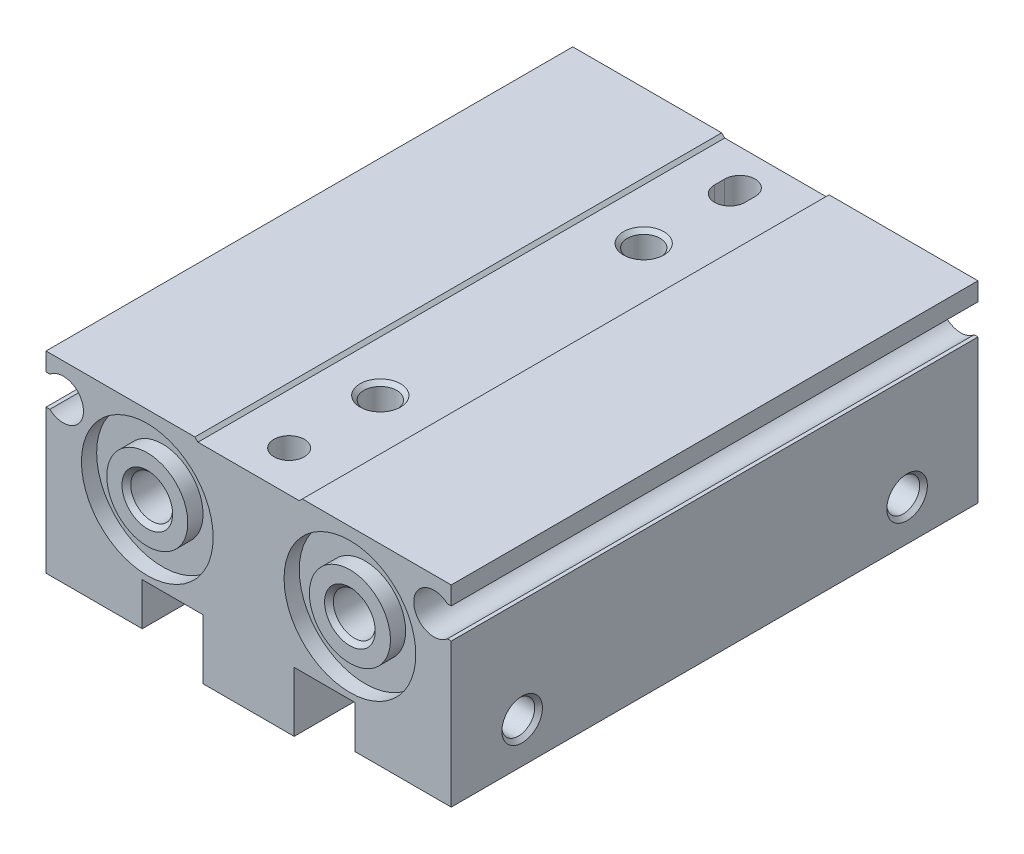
ISO-10303-21;
HEADER;
FILE_DESCRIPTION(('STEP AP214'),'2;1');
FILE_NAME('part.step','',(''),(''),'','','');
FILE_SCHEMA(('AUTOMOTIVE_DESIGN { 1 0 10303 214 1 1 1 1 }'));
ENDSEC;
DATA;
#1=APPLICATION_CONTEXT('core data for automotive mechanical design processes');
#2=APPLICATION_PROTOCOL_DEFINITION('international standard','automotive_design',2000,#1);
#3=PRODUCT_CONTEXT('',#1,'mechanical');
#4=PRODUCT('Part','Part','',(#3));
#5=PRODUCT_RELATED_PRODUCT_CATEGORY('part','',(#4));
#6=PRODUCT_DEFINITION_FORMATION('','',#4);
#7=PRODUCT_DEFINITION_CONTEXT('part definition',#1,'design');
#8=PRODUCT_DEFINITION('design','',#6,#7);
#9=PRODUCT_DEFINITION_SHAPE('','',#8);
#10=(LENGTH_UNIT() NAMED_UNIT(*) SI_UNIT(.MILLI.,.METRE.));
#11=(NAMED_UNIT(*) PLANE_ANGLE_UNIT() SI_UNIT($,.RADIAN.));
#12=(NAMED_UNIT(*) SI_UNIT($,.STERADIAN.) SOLID_ANGLE_UNIT());
#13=UNCERTAINTY_MEASURE_WITH_UNIT(LENGTH_MEASURE(1.E-05),#10,'distance_accuracy_value','');
#14=(GEOMETRIC_REPRESENTATION_CONTEXT(3) GLOBAL_UNCERTAINTY_ASSIGNED_CONTEXT((#13)) GLOBAL_UNIT_ASSIGNED_CONTEXT((#10,
#11,#12)) REPRESENTATION_CONTEXT('',''));
#15=CARTESIAN_POINT('',(0.,0.,0.));
#16=DIRECTION('',(0.,0.,1.));
#17=DIRECTION('',(1.,0.,0.));
#18=AXIS2_PLACEMENT_3D('',#15,#16,#17);
#19=CARTESIAN_POINT('',(4.5,-14.8,-5.));
#20=DIRECTION('',(0.,-1.,0.));
#21=DIRECTION('',(1.,0.,0.));
#22=AXIS2_PLACEMENT_3D('',#19,#20,#21);
#23=PLANE('',#22);
#24=DIRECTION('',(1.,0.,0.));
#25=VECTOR('',#24,1.);
#26=CARTESIAN_POINT('',(4.5,-14.8,-5.));
#27=LINE('',#26,#25);
#28=CARTESIAN_POINT('',(4.5,-14.8,-5.));
#29=VERTEX_POINT('',#28);
#30=CARTESIAN_POINT('',(10.5,-14.8,-5.));
#31=VERTEX_POINT('',#30);
#32=EDGE_CURVE('E251',#29,#31,#27,.T.);
#33=ORIENTED_EDGE('',*,*,#32,.T.);
#34=DIRECTION('',(0.,0.,1.));
#35=VECTOR('',#34,1.);
#36=CARTESIAN_POINT('',(10.5,-14.8,-5.));
#37=LINE('',#36,#35);
#38=CARTESIAN_POINT('',(10.5,-14.8,26.));
#39=VERTEX_POINT('',#38);
#40=EDGE_CURVE('E264',#39,#31,#37,.F.);
#41=ORIENTED_EDGE('',*,*,#40,.F.);
#42=DIRECTION('',(-1.,0.,0.));
#43=VECTOR('',#42,1.);
#44=CARTESIAN_POINT('',(10.5,-14.8,26.));
#45=LINE('',#44,#43);
#46=CARTESIAN_POINT('',(4.5,-14.8,26.));
#47=VERTEX_POINT('',#46);
#48=EDGE_CURVE('E272',#47,#39,#45,.F.);
#49=ORIENTED_EDGE('',*,*,#48,.F.);
#50=DIRECTION('',(0.,0.,-1.));
#51=VECTOR('',#50,1.);
#52=CARTESIAN_POINT('',(4.5,-14.8,26.));
#53=LINE('',#52,#51);
#54=EDGE_CURVE('E266',#47,#29,#53,.T.);
#55=ORIENTED_EDGE('',*,*,#54,.T.);
#56=EDGE_LOOP('',(#33,#41,#49,#55));
#57=FACE_BOUND('',#56,.T.);
#58=ADVANCED_FACE('F16',(#57),#23,.T.);
#59=CARTESIAN_POINT('',(4.5,-14.8,-26.));
#60=DIRECTION('',(0.,-1.,0.));
#61=DIRECTION('',(1.,0.,0.));
#62=AXIS2_PLACEMENT_3D('',#59,#60,#61);
#63=PLANE('',#62);
#64=DIRECTION('',(-1.,0.,0.));
#65=VECTOR('',#64,1.);
#66=CARTESIAN_POINT('',(10.5,-14.8,-12.));
#67=LINE('',#66,#65);
#68=CARTESIAN_POINT('',(10.5,-14.8,-12.));
#69=VERTEX_POINT('',#68);
#70=CARTESIAN_POINT('',(4.5,-14.8,-12.));
#71=VERTEX_POINT('',#70);
#72=EDGE_CURVE('E283',#69,#71,#67,.T.);
#73=ORIENTED_EDGE('',*,*,#72,.T.);
#74=DIRECTION('',(0.,0.,-1.));
#75=VECTOR('',#74,1.);
#76=CARTESIAN_POINT('',(4.5,-14.8,-12.));
#77=LINE('',#76,#75);
#78=CARTESIAN_POINT('',(4.5,-14.8,-26.));
#79=VERTEX_POINT('',#78);
#80=EDGE_CURVE('E288',#71,#79,#77,.T.);
#81=ORIENTED_EDGE('',*,*,#80,.T.);
#82=DIRECTION('',(1.,0.,0.));
#83=VECTOR('',#82,1.);
#84=CARTESIAN_POINT('',(4.5,-14.8,-26.));
#85=LINE('',#84,#83);
#86=CARTESIAN_POINT('',(10.5,-14.8,-26.));
#87=VERTEX_POINT('',#86);
#88=EDGE_CURVE('E293',#79,#87,#85,.T.);
#89=ORIENTED_EDGE('',*,*,#88,.T.);
#90=DIRECTION('',(0.,0.,1.));
#91=VECTOR('',#90,1.);
#92=CARTESIAN_POINT('',(10.5,-14.8,-26.));
#93=LINE('',#92,#91);
#94=EDGE_CURVE('E298',#69,#87,#93,.F.);
#95=ORIENTED_EDGE('',*,*,#94,.F.);
#96=EDGE_LOOP('',(#73,#81,#89,#95));
#97=FACE_BOUND('',#96,.T.);
#98=ADVANCED_FACE('F948',(#97),#63,.T.);
#99=CARTESIAN_POINT('',(-10.5,-14.8,12.));
#100=DIRECTION('',(0.,-1.,0.));
#101=DIRECTION('',(1.,0.,0.));
#102=AXIS2_PLACEMENT_3D('',#99,#100,#101);
#103=PLANE('',#102);
#104=DIRECTION('',(1.,0.,0.));
#105=VECTOR('',#104,1.);
#106=CARTESIAN_POINT('',(-10.5,-14.8,12.));
#107=LINE('',#106,#105);
#108=CARTESIAN_POINT('',(-10.5,-14.8,12.));
#109=VERTEX_POINT('',#108);
#110=CARTESIAN_POINT('',(-4.5,-14.8,12.));
#111=VERTEX_POINT('',#110);
#112=EDGE_CURVE('E303',#109,#111,#107,.T.);
#113=ORIENTED_EDGE('',*,*,#112,.T.);
#114=DIRECTION('',(0.,0.,1.));
#115=VECTOR('',#114,1.);
#116=CARTESIAN_POINT('',(-4.5,-14.8,12.));
#117=LINE('',#116,#115);
#118=CARTESIAN_POINT('',(-4.5,-14.8,26.));
#119=VERTEX_POINT('',#118);
#120=EDGE_CURVE('E308',#119,#111,#117,.F.);
#121=ORIENTED_EDGE('',*,*,#120,.F.);
#122=DIRECTION('',(-1.,0.,0.));
#123=VECTOR('',#122,1.);
#124=CARTESIAN_POINT('',(-4.5,-14.8,26.));
#125=LINE('',#124,#123);
#126=CARTESIAN_POINT('',(-10.5,-14.8,26.));
#127=VERTEX_POINT('',#126);
#128=EDGE_CURVE('E313',#127,#119,#125,.F.);
#129=ORIENTED_EDGE('',*,*,#128,.F.);
#130=DIRECTION('',(0.,0.,-1.));
#131=VECTOR('',#130,1.);
#132=CARTESIAN_POINT('',(-10.5,-14.8,26.));
#133=LINE('',#132,#131);
#134=EDGE_CURVE('E317',#127,#109,#133,.T.);
#135=ORIENTED_EDGE('',*,*,#134,.T.);
#136=EDGE_LOOP('',(#113,#121,#129,#135));
#137=FACE_BOUND('',#136,.T.);
#138=ADVANCED_FACE('F953',(#137),#103,.T.);
#139=CARTESIAN_POINT('',(-10.5,-14.8,-26.));
#140=DIRECTION('',(0.,-1.,0.));
#141=DIRECTION('',(1.,0.,0.));
#142=AXIS2_PLACEMENT_3D('',#139,#140,#141);
#143=PLANE('',#142);
#144=DIRECTION('',(-1.,0.,0.));
#145=VECTOR('',#144,1.);
#146=CARTESIAN_POINT('',(-4.5,-14.8,5.));
#147=LINE('',#146,#145);
#148=CARTESIAN_POINT('',(-4.5,-14.8,5.));
#149=VERTEX_POINT('',#148);
#150=CARTESIAN_POINT('',(-10.5,-14.8,5.));
#151=VERTEX_POINT('',#150);
#152=EDGE_CURVE('E322',#149,#151,#147,.T.);
#153=ORIENTED_EDGE('',*,*,#152,.T.);
#154=DIRECTION('',(0.,0.,-1.));
#155=VECTOR('',#154,1.);
#156=CARTESIAN_POINT('',(-10.5,-14.8,5.));
#157=LINE('',#156,#155);
#158=CARTESIAN_POINT('',(-10.5,-14.8,-26.));
#159=VERTEX_POINT('',#158);
#160=EDGE_CURVE('E327',#151,#159,#157,.T.);
#161=ORIENTED_EDGE('',*,*,#160,.T.);
#162=DIRECTION('',(1.,0.,0.));
#163=VECTOR('',#162,1.);
#164=CARTESIAN_POINT('',(-10.5,-14.8,-26.));
#165=LINE('',#164,#163);
#166=CARTESIAN_POINT('',(-4.5,-14.8,-26.));
#167=VERTEX_POINT('',#166);
#168=EDGE_CURVE('E332',#159,#167,#165,.T.);
#169=ORIENTED_EDGE('',*,*,#168,.T.);
#170=DIRECTION('',(0.,0.,1.));
#171=VECTOR('',#170,1.);
#172=CARTESIAN_POINT('',(-4.5,-14.8,-26.));
#173=LINE('',#172,#171);
#174=EDGE_CURVE('E337',#149,#167,#173,.F.);
#175=ORIENTED_EDGE('',*,*,#174,.F.);
#176=EDGE_LOOP('',(#153,#161,#169,#175));
#177=FACE_BOUND('',#176,.T.);
#178=ADVANCED_FACE('F959',(#177),#143,.T.);
#179=CARTESIAN_POINT('',(-20.,-4.8,26.));
#180=DIRECTION('',(0.,1.,0.));
#181=DIRECTION('',(1.,0.,0.));
#182=AXIS2_PLACEMENT_3D('',#179,#180,#181);
#183=PLANE('',#182);
#184=DIRECTION('',(-1.,0.,0.));
#185=VECTOR('',#184,1.);
#186=CARTESIAN_POINT('',(-19.622875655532,-4.8,-26.));
#187=LINE('',#186,#185);
#188=CARTESIAN_POINT('',(-19.622875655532,-4.8,-26.));
#189=VERTEX_POINT('',#188);
#190=CARTESIAN_POINT('',(-20.,-4.8,-26.));
#191=VERTEX_POINT('',#190);
#192=EDGE_CURVE('E342',#189,#191,#187,.T.);
#193=ORIENTED_EDGE('',*,*,#192,.T.);
#194=DIRECTION('',(0.,0.,1.));
#195=VECTOR('',#194,1.);
#196=CARTESIAN_POINT('',(-20.,-4.8,-26.));
#197=LINE('',#196,#195);
#198=CARTESIAN_POINT('',(-20.,-4.8,26.));
#199=VERTEX_POINT('',#198);
#200=EDGE_CURVE('E347',#199,#191,#197,.F.);
#201=ORIENTED_EDGE('',*,*,#200,.F.);
#202=DIRECTION('',(1.,0.,0.));
#203=VECTOR('',#202,1.);
#204=CARTESIAN_POINT('',(-20.,-4.8,26.));
#205=LINE('',#204,#203);
#206=CARTESIAN_POINT('',(-19.622875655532,-4.8,26.));
#207=VERTEX_POINT('',#206);
#208=EDGE_CURVE('E352',#207,#199,#205,.F.);
#209=ORIENTED_EDGE('',*,*,#208,.F.);
#210=DIRECTION('',(0.,0.,-1.));
#211=VECTOR('',#210,1.);
#212=CARTESIAN_POINT('',(-19.622875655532,-4.8,26.));
#213=LINE('',#212,#211);
#214=EDGE_CURVE('E356',#207,#189,#213,.T.);
#215=ORIENTED_EDGE('',*,*,#214,.T.);
#216=EDGE_LOOP('',(#193,#201,#209,#215));
#217=FACE_BOUND('',#216,.T.);
#218=ADVANCED_FACE('F963',(#217),#183,.T.);
#219=CARTESIAN_POINT('',(-20.,-19.,26.));
#220=DIRECTION('',(-1.,0.,0.));
#221=DIRECTION('',(0.,1.,0.));
#222=AXIS2_PLACEMENT_3D('',#219,#220,#221);
#223=PLANE('',#222);
#224=DIRECTION('',(0.,-1.,0.));
#225=VECTOR('',#224,1.);
#226=CARTESIAN_POINT('',(-20.,-4.8,-26.));
#227=LINE('',#226,#225);
#228=CARTESIAN_POINT('',(-20.,-19.,-26.));
#229=VERTEX_POINT('',#228);
#230=EDGE_CURVE('E361',#191,#229,#227,.T.);
#231=ORIENTED_EDGE('',*,*,#230,.T.);
#232=DIRECTION('',(0.,0.,1.));
#233=VECTOR('',#232,1.);
#234=CARTESIAN_POINT('',(-20.,-19.,-26.));
#235=LINE('',#234,#233);
#236=CARTESIAN_POINT('',(-20.,-19.,26.));
#237=VERTEX_POINT('',#236);
#238=EDGE_CURVE('E366',#237,#229,#235,.F.);
#239=ORIENTED_EDGE('',*,*,#238,.F.);
#240=DIRECTION('',(0.,1.,0.));
#241=VECTOR('',#240,1.);
#242=CARTESIAN_POINT('',(-20.,-19.,26.));
#243=LINE('',#242,#241);
#244=EDGE_CURVE('E371',#199,#237,#243,.F.);
#245=ORIENTED_EDGE('',*,*,#244,.F.);
#246=ORIENTED_EDGE('',*,*,#200,.T.);
#247=EDGE_LOOP('',(#231,#239,#245,#246));
#248=FACE_BOUND('',#247,.T.);
#249=CARTESIAN_POINT('',(-20.,-15.,-19.));
#250=DIRECTION('',(1.,0.,0.));
#251=DIRECTION('',(0.,0.,1.));
#252=AXIS2_PLACEMENT_3D('',#249,#250,#251);
#253=CIRCLE('',#252,2.);
#254=CARTESIAN_POINT('',(-20.,-15.,-17.));
#255=VERTEX_POINT('',#254);
#256=EDGE_CURVE('E375',#255,#255,#253,.F.);
#257=ORIENTED_EDGE('',*,*,#256,.F.);
#258=EDGE_LOOP('',(#257));
#259=FACE_BOUND('',#258,.T.);
#260=CARTESIAN_POINT('',(-20.,-15.,19.));
#261=DIRECTION('',(1.,0.,0.));
#262=DIRECTION('',(0.,0.,1.));
#263=AXIS2_PLACEMENT_3D('',#260,#261,#262);
#264=CIRCLE('',#263,2.);
#265=CARTESIAN_POINT('',(-20.,-15.,21.));
#266=VERTEX_POINT('',#265);
#267=EDGE_CURVE('E380',#266,#266,#264,.F.);
#268=ORIENTED_EDGE('',*,*,#267,.F.);
#269=EDGE_LOOP('',(#268));
#270=FACE_BOUND('',#269,.T.);
#271=ADVANCED_FACE('F967',(#248,#259,#270),#223,.T.);
#272=CARTESIAN_POINT('',(-20.,-19.,-26.));
#273=DIRECTION('',(0.,-1.,0.));
#274=DIRECTION('',(1.,0.,0.));
#275=AXIS2_PLACEMENT_3D('',#272,#273,#274);
#276=PLANE('',#275);
#277=DIRECTION('',(1.,0.,0.));
#278=VECTOR('',#277,1.);
#279=CARTESIAN_POINT('',(-20.,-19.,-26.));
#280=LINE('',#279,#278);
#281=CARTESIAN_POINT('',(-10.5,-19.,-26.));
#282=VERTEX_POINT('',#281);
#283=EDGE_CURVE('E383',#229,#282,#280,.T.);
#284=ORIENTED_EDGE('',*,*,#283,.T.);
#285=DIRECTION('',(0.,0.,1.));
#286=VECTOR('',#285,1.);
#287=CARTESIAN_POINT('',(-10.5,-19.,-26.));
#288=LINE('',#287,#286);
#289=CARTESIAN_POINT('',(-10.5,-19.,26.));
#290=VERTEX_POINT('',#289);
#291=EDGE_CURVE('E386',#290,#282,#288,.F.);
#292=ORIENTED_EDGE('',*,*,#291,.F.);
#293=DIRECTION('',(-1.,0.,0.));
#294=VECTOR('',#293,1.);
#295=CARTESIAN_POINT('',(-10.5,-19.,26.));
#296=LINE('',#295,#294);
#297=EDGE_CURVE('E391',#237,#290,#296,.F.);
#298=ORIENTED_EDGE('',*,*,#297,.F.);
#299=ORIENTED_EDGE('',*,*,#238,.T.);
#300=EDGE_LOOP('',(#284,#292,#298,#299));
#301=FACE_BOUND('',#300,.T.);
#302=CARTESIAN_POINT('',(-16.5,-19.,14.));
#303=DIRECTION('',(0.,1.,0.));
#304=DIRECTION('',(-1.42053956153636E-07,0.,-0.99999999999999));
#305=AXIS2_PLACEMENT_3D('',#302,#303,#304);
#306=CIRCLE('',#305,2.);
#307=CARTESIAN_POINT('',(-16.5000002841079,-19.,12.));
#308=VERTEX_POINT('',#307);
#309=EDGE_CURVE('E395',#308,#308,#306,.T.);
#310=ORIENTED_EDGE('',*,*,#309,.T.);
#311=EDGE_LOOP('',(#310));
#312=FACE_BOUND('',#311,.T.);
#313=CARTESIAN_POINT('',(-16.5,-19.,-14.));
#314=DIRECTION('',(0.,1.,0.));
#315=DIRECTION('',(0.,0.,-1.));
#316=AXIS2_PLACEMENT_3D('',#313,#314,#315);
#317=CIRCLE('',#316,2.);
#318=CARTESIAN_POINT('',(-16.5,-19.,-16.));
#319=VERTEX_POINT('',#318);
#320=EDGE_CURVE('E400',#319,#319,#317,.T.);
#321=ORIENTED_EDGE('',*,*,#320,.T.);
#322=EDGE_LOOP('',(#321));
#323=FACE_BOUND('',#322,.T.);
#324=ADVANCED_FACE('F971',(#301,#312,#323),#276,.T.);
#325=CARTESIAN_POINT('',(-10.5,-19.,-26.));
#326=DIRECTION('',(1.,0.,0.));
#327=DIRECTION('',(0.,1.,0.));
#328=AXIS2_PLACEMENT_3D('',#325,#326,#327);
#329=PLANE('',#328);
#330=DIRECTION('',(0.,1.,0.));
#331=VECTOR('',#330,1.);
#332=CARTESIAN_POINT('',(-10.5,-19.,-26.));
#333=LINE('',#332,#331);
#334=EDGE_CURVE('E403',#282,#159,#333,.T.);
#335=ORIENTED_EDGE('',*,*,#334,.T.);
#336=ORIENTED_EDGE('',*,*,#160,.F.);
#337=DIRECTION('',(0.,1.,0.));
#338=VECTOR('',#337,1.);
#339=CARTESIAN_POINT('',(-10.5,-14.8,4.99999999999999));
#340=LINE('',#339,#338);
#341=CARTESIAN_POINT('',(-10.5,-13.2,4.99999999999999));
#342=VERTEX_POINT('',#341);
#343=EDGE_CURVE('E406',#342,#151,#340,.F.);
#344=ORIENTED_EDGE('',*,*,#343,.F.);
#345=DIRECTION('',(0.,0.,1.));
#346=VECTOR('',#345,1.);
#347=CARTESIAN_POINT('',(-10.5,-13.2,4.99999999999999));
#348=LINE('',#347,#346);
#349=CARTESIAN_POINT('',(-10.5,-13.2,12.));
#350=VERTEX_POINT('',#349);
#351=EDGE_CURVE('E410',#342,#350,#348,.T.);
#352=ORIENTED_EDGE('',*,*,#351,.T.);
#353=DIRECTION('',(0.,-1.,0.));
#354=VECTOR('',#353,1.);
#355=CARTESIAN_POINT('',(-10.5,-13.2,12.));
#356=LINE('',#355,#354);
#357=EDGE_CURVE('E415',#350,#109,#356,.T.);
#358=ORIENTED_EDGE('',*,*,#357,.T.);
#359=ORIENTED_EDGE('',*,*,#134,.F.);
#360=DIRECTION('',(0.,-1.,0.));
#361=VECTOR('',#360,1.);
#362=CARTESIAN_POINT('',(-10.5,-14.8,26.));
#363=LINE('',#362,#361);
#364=EDGE_CURVE('E420',#290,#127,#363,.F.);
#365=ORIENTED_EDGE('',*,*,#364,.F.);
#366=ORIENTED_EDGE('',*,*,#291,.T.);
#367=EDGE_LOOP('',(#335,#336,#344,#352,#358,#359,#365,#366));
#368=FACE_BOUND('',#367,.T.);
#369=ADVANCED_FACE('F975',(#368),#329,.T.);
#370=CARTESIAN_POINT('',(-4.5,-20.7,26.));
#371=DIRECTION('',(-1.,0.,0.));
#372=DIRECTION('',(0.,1.,0.));
#373=AXIS2_PLACEMENT_3D('',#370,#371,#372);
#374=PLANE('',#373);
#375=DIRECTION('',(0.,-1.,0.));
#376=VECTOR('',#375,1.);
#377=CARTESIAN_POINT('',(-4.5,-14.8,-26.));
#378=LINE('',#377,#376);
#379=CARTESIAN_POINT('',(-4.5,-20.7,-26.));
#380=VERTEX_POINT('',#379);
#381=EDGE_CURVE('E424',#167,#380,#378,.T.);
#382=ORIENTED_EDGE('',*,*,#381,.T.);
#383=DIRECTION('',(0.,0.,1.));
#384=VECTOR('',#383,1.);
#385=CARTESIAN_POINT('',(-4.5,-20.7,-26.));
#386=LINE('',#385,#384);
#387=CARTESIAN_POINT('',(-4.5,-20.7,26.));
#388=VERTEX_POINT('',#387);
#389=EDGE_CURVE('E429',#388,#380,#386,.F.);
#390=ORIENTED_EDGE('',*,*,#389,.F.);
#391=DIRECTION('',(0.,1.,0.));
#392=VECTOR('',#391,1.);
#393=CARTESIAN_POINT('',(-4.5,-20.7,26.));
#394=LINE('',#393,#392);
#395=EDGE_CURVE('E434',#119,#388,#394,.F.);
#396=ORIENTED_EDGE('',*,*,#395,.F.);
#397=ORIENTED_EDGE('',*,*,#120,.T.);
#398=DIRECTION('',(0.,1.,0.));
#399=VECTOR('',#398,1.);
#400=CARTESIAN_POINT('',(-4.5,-14.8,12.));
#401=LINE('',#400,#399);
#402=CARTESIAN_POINT('',(-4.5,-13.2,12.));
#403=VERTEX_POINT('',#402);
#404=EDGE_CURVE('E438',#403,#111,#401,.F.);
#405=ORIENTED_EDGE('',*,*,#404,.F.);
#406=DIRECTION('',(0.,0.,-1.));
#407=VECTOR('',#406,1.);
#408=CARTESIAN_POINT('',(-4.5,-13.2,12.));
#409=LINE('',#408,#407);
#410=CARTESIAN_POINT('',(-4.5,-13.2,5.));
#411=VERTEX_POINT('',#410);
#412=EDGE_CURVE('E442',#403,#411,#409,.T.);
#413=ORIENTED_EDGE('',*,*,#412,.T.);
#414=DIRECTION('',(0.,-1.,0.));
#415=VECTOR('',#414,1.);
#416=CARTESIAN_POINT('',(-4.5,-13.2,5.));
#417=LINE('',#416,#415);
#418=EDGE_CURVE('E447',#411,#149,#417,.T.);
#419=ORIENTED_EDGE('',*,*,#418,.T.);
#420=ORIENTED_EDGE('',*,*,#174,.T.);
#421=EDGE_LOOP('',(#382,#390,#396,#397,#405,#413,#419,#420));
#422=FACE_BOUND('',#421,.T.);
#423=ADVANCED_FACE('F979',(#422),#374,.T.);
#424=CARTESIAN_POINT('',(-4.5,-20.7,-26.));
#425=DIRECTION('',(0.,-1.,0.));
#426=DIRECTION('',(1.,0.,0.));
#427=AXIS2_PLACEMENT_3D('',#424,#425,#426);
#428=PLANE('',#427);
#429=DIRECTION('',(1.,0.,0.));
#430=VECTOR('',#429,1.);
#431=CARTESIAN_POINT('',(-4.5,-20.7,-26.));
#432=LINE('',#431,#430);
#433=CARTESIAN_POINT('',(4.5,-20.7,-26.));
#434=VERTEX_POINT('',#433);
#435=EDGE_CURVE('E452',#380,#434,#432,.T.);
#436=ORIENTED_EDGE('',*,*,#435,.T.);
#437=DIRECTION('',(0.,0.,1.));
#438=VECTOR('',#437,1.);
#439=CARTESIAN_POINT('',(4.5,-20.7,-26.));
#440=LINE('',#439,#438);
#441=CARTESIAN_POINT('',(4.5,-20.7,26.));
#442=VERTEX_POINT('',#441);
#443=EDGE_CURVE('E457',#442,#434,#440,.F.);
#444=ORIENTED_EDGE('',*,*,#443,.F.);
#445=DIRECTION('',(-1.,0.,0.));
#446=VECTOR('',#445,1.);
#447=CARTESIAN_POINT('',(4.5,-20.7,26.));
#448=LINE('',#447,#446);
#449=EDGE_CURVE('E462',#388,#442,#448,.F.);
#450=ORIENTED_EDGE('',*,*,#449,.F.);
#451=ORIENTED_EDGE('',*,*,#389,.T.);
#452=EDGE_LOOP('',(#436,#444,#450,#451));
#453=FACE_BOUND('',#452,.T.);
#454=CARTESIAN_POINT('',(0.,-20.7,-13.));
#455=DIRECTION('',(0.,1.,0.));
#456=DIRECTION('',(0.,0.,-1.));
#457=AXIS2_PLACEMENT_3D('',#454,#455,#456);
#458=CIRCLE('',#457,2.75);
#459=CARTESIAN_POINT('',(0.,-20.7,-15.75));
#460=VERTEX_POINT('',#459);
#461=EDGE_CURVE('E466',#460,#460,#458,.F.);
#462=ORIENTED_EDGE('',*,*,#461,.F.);
#463=EDGE_LOOP('',(#462));
#464=FACE_BOUND('',#463,.T.);
#465=CARTESIAN_POINT('',(0.,-20.7,13.));
#466=DIRECTION('',(0.,1.,0.));
#467=DIRECTION('',(0.,0.,-1.));
#468=AXIS2_PLACEMENT_3D('',#465,#466,#467);
#469=CIRCLE('',#468,2.75);
#470=CARTESIAN_POINT('',(0.,-20.7,10.25));
#471=VERTEX_POINT('',#470);
#472=EDGE_CURVE('E471',#471,#471,#469,.F.);
#473=ORIENTED_EDGE('',*,*,#472,.F.);
#474=EDGE_LOOP('',(#473));
#475=FACE_BOUND('',#474,.T.);
#476=ADVANCED_FACE('F983',(#453,#464,#475),#428,.T.);
#477=CARTESIAN_POINT('',(4.5,-20.7,-26.));
#478=DIRECTION('',(1.,0.,0.));
#479=DIRECTION('',(0.,1.,0.));
#480=AXIS2_PLACEMENT_3D('',#477,#478,#479);
#481=PLANE('',#480);
#482=DIRECTION('',(0.,1.,0.));
#483=VECTOR('',#482,1.);
#484=CARTESIAN_POINT('',(4.5,-20.7,-26.));
#485=LINE('',#484,#483);
#486=EDGE_CURVE('E474',#434,#79,#485,.T.);
#487=ORIENTED_EDGE('',*,*,#486,.T.);
#488=ORIENTED_EDGE('',*,*,#80,.F.);
#489=DIRECTION('',(0.,1.,0.));
#490=VECTOR('',#489,1.);
#491=CARTESIAN_POINT('',(4.5,-14.8,-12.));
#492=LINE('',#491,#490);
#493=CARTESIAN_POINT('',(4.5,-13.2,-12.));
#494=VERTEX_POINT('',#493);
#495=EDGE_CURVE('E477',#494,#71,#492,.F.);
#496=ORIENTED_EDGE('',*,*,#495,.F.);
#497=DIRECTION('',(0.,0.,1.));
#498=VECTOR('',#497,1.);
#499=CARTESIAN_POINT('',(4.5,-13.2,-12.));
#500=LINE('',#499,#498);
#501=CARTESIAN_POINT('',(4.5,-13.2,-5.));
#502=VERTEX_POINT('',#501);
#503=EDGE_CURVE('E481',#494,#502,#500,.T.);
#504=ORIENTED_EDGE('',*,*,#503,.T.);
#505=DIRECTION('',(0.,-1.,0.));
#506=VECTOR('',#505,1.);
#507=CARTESIAN_POINT('',(4.5,-13.2,-5.));
#508=LINE('',#507,#506);
#509=EDGE_CURVE('E486',#502,#29,#508,.T.);
#510=ORIENTED_EDGE('',*,*,#509,.T.);
#511=ORIENTED_EDGE('',*,*,#54,.F.);
#512=DIRECTION('',(0.,-1.,0.));
#513=VECTOR('',#512,1.);
#514=CARTESIAN_POINT('',(4.5,-14.8,26.));
#515=LINE('',#514,#513);
#516=EDGE_CURVE('E490',#442,#47,#515,.F.);
#517=ORIENTED_EDGE('',*,*,#516,.F.);
#518=ORIENTED_EDGE('',*,*,#443,.T.);
#519=EDGE_LOOP('',(#487,#488,#496,#504,#510,#511,#517,#518));
#520=FACE_BOUND('',#519,.T.);
#521=ADVANCED_FACE('F987',(#520),#481,.T.);
#522=CARTESIAN_POINT('',(10.5,-19.,26.));
#523=DIRECTION('',(-1.,0.,0.));
#524=DIRECTION('',(0.,1.,0.));
#525=AXIS2_PLACEMENT_3D('',#522,#523,#524);
#526=PLANE('',#525);
#527=DIRECTION('',(0.,-1.,0.));
#528=VECTOR('',#527,1.);
#529=CARTESIAN_POINT('',(10.5,-14.8,-26.));
#530=LINE('',#529,#528);
#531=CARTESIAN_POINT('',(10.5,-19.,-26.));
#532=VERTEX_POINT('',#531);
#533=EDGE_CURVE('E494',#87,#532,#530,.T.);
#534=ORIENTED_EDGE('',*,*,#533,.T.);
#535=DIRECTION('',(0.,0.,1.));
#536=VECTOR('',#535,1.);
#537=CARTESIAN_POINT('',(10.5,-19.,-26.));
#538=LINE('',#537,#536);
#539=CARTESIAN_POINT('',(10.5,-19.,26.));
#540=VERTEX_POINT('',#539);
#541=EDGE_CURVE('E498',#540,#532,#538,.F.);
#542=ORIENTED_EDGE('',*,*,#541,.F.);
#543=DIRECTION('',(0.,1.,0.));
#544=VECTOR('',#543,1.);
#545=CARTESIAN_POINT('',(10.5,-19.,26.));
#546=LINE('',#545,#544);
#547=EDGE_CURVE('E258',#39,#540,#546,.F.);
#548=ORIENTED_EDGE('',*,*,#547,.F.);
#549=ORIENTED_EDGE('',*,*,#40,.T.);
#550=DIRECTION('',(0.,1.,0.));
#551=VECTOR('',#550,1.);
#552=CARTESIAN_POINT('',(10.5,-14.8,-5.));
#553=LINE('',#552,#551);
#554=CARTESIAN_POINT('',(10.5,-13.2,-5.));
#555=VERTEX_POINT('',#554);
#556=EDGE_CURVE('E247',#555,#31,#553,.F.);
#557=ORIENTED_EDGE('',*,*,#556,.F.);
#558=DIRECTION('',(0.,0.,-1.));
#559=VECTOR('',#558,1.);
#560=CARTESIAN_POINT('',(10.5,-13.2,-5.));
#561=LINE('',#560,#559);
#562=CARTESIAN_POINT('',(10.5,-13.2,-12.));
#563=VERTEX_POINT('',#562);
#564=EDGE_CURVE('E257',#555,#563,#561,.T.);
#565=ORIENTED_EDGE('',*,*,#564,.T.);
#566=DIRECTION('',(0.,-1.,0.));
#567=VECTOR('',#566,1.);
#568=CARTESIAN_POINT('',(10.5,-13.2,-12.));
#569=LINE('',#568,#567);
#570=EDGE_CURVE('E511',#563,#69,#569,.T.);
#571=ORIENTED_EDGE('',*,*,#570,.T.);
#572=ORIENTED_EDGE('',*,*,#94,.T.);
#573=EDGE_LOOP('',(#534,#542,#548,#549,#557,#565,#571,#572));
#574=FACE_BOUND('',#573,.T.);
#575=ADVANCED_FACE('F270',(#574),#526,.T.);
#576=CARTESIAN_POINT('',(10.5,-19.,-26.));
#577=DIRECTION('',(0.,-1.,0.));
#578=DIRECTION('',(1.,0.,0.));
#579=AXIS2_PLACEMENT_3D('',#576,#577,#578);
#580=PLANE('',#579);
#581=DIRECTION('',(1.,0.,0.));
#582=VECTOR('',#581,1.);
#583=CARTESIAN_POINT('',(10.5,-19.,-26.));
#584=LINE('',#583,#582);
#585=CARTESIAN_POINT('',(20.,-19.,-26.));
#586=VERTEX_POINT('',#585);
#587=EDGE_CURVE('E516',#532,#586,#584,.T.);
#588=ORIENTED_EDGE('',*,*,#587,.T.);
#589=DIRECTION('',(0.,0.,1.));
#590=VECTOR('',#589,1.);
#591=CARTESIAN_POINT('',(20.,-19.,-26.));
#592=LINE('',#591,#590);
#593=CARTESIAN_POINT('',(20.,-19.,26.));
#594=VERTEX_POINT('',#593);
#595=EDGE_CURVE('E521',#594,#586,#592,.F.);
#596=ORIENTED_EDGE('',*,*,#595,.F.);
#597=DIRECTION('',(-1.,0.,0.));
#598=VECTOR('',#597,1.);
#599=CARTESIAN_POINT('',(20.,-19.,26.));
#600=LINE('',#599,#598);
#601=EDGE_CURVE('E526',#540,#594,#600,.F.);
#602=ORIENTED_EDGE('',*,*,#601,.F.);
#603=ORIENTED_EDGE('',*,*,#541,.T.);
#604=EDGE_LOOP('',(#588,#596,#602,#603));
#605=FACE_BOUND('',#604,.T.);
#606=CARTESIAN_POINT('',(16.5,-19.,-14.));
#607=DIRECTION('',(0.,1.,0.));
#608=DIRECTION('',(0.,0.,-1.));
#609=AXIS2_PLACEMENT_3D('',#606,#607,#608);
#610=CIRCLE('',#609,2.);
#611=CARTESIAN_POINT('',(16.5,-19.,-16.));
#612=VERTEX_POINT('',#611);
#613=EDGE_CURVE('E530',#612,#612,#610,.T.);
#614=ORIENTED_EDGE('',*,*,#613,.T.);
#615=EDGE_LOOP('',(#614));
#616=FACE_BOUND('',#615,.T.);
#617=CARTESIAN_POINT('',(16.5,-19.,14.));
#618=DIRECTION('',(0.,1.,0.));
#619=DIRECTION('',(-1.42053956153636E-07,0.,-0.99999999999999));
#620=AXIS2_PLACEMENT_3D('',#617,#618,#619);
#621=CIRCLE('',#620,2.);
#622=CARTESIAN_POINT('',(16.4999997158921,-19.,12.));
#623=VERTEX_POINT('',#622);
#624=EDGE_CURVE('E535',#623,#623,#621,.T.);
#625=ORIENTED_EDGE('',*,*,#624,.T.);
#626=EDGE_LOOP('',(#625));
#627=FACE_BOUND('',#626,.T.);
#628=ADVANCED_FACE('F994',(#605,#616,#627),#580,.T.);
#629=CARTESIAN_POINT('',(20.,-19.,-26.));
#630=DIRECTION('',(1.,0.,0.));
#631=DIRECTION('',(0.,1.,0.));
#632=AXIS2_PLACEMENT_3D('',#629,#630,#631);
#633=PLANE('',#632);
#634=DIRECTION('',(0.,1.,0.));
#635=VECTOR('',#634,1.);
#636=CARTESIAN_POINT('',(20.,-19.,-26.));
#637=LINE('',#636,#635);
#638=CARTESIAN_POINT('',(20.,-4.80000000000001,-26.));
#639=VERTEX_POINT('',#638);
#640=EDGE_CURVE('E538',#586,#639,#637,.T.);
#641=ORIENTED_EDGE('',*,*,#640,.T.);
#642=DIRECTION('',(0.,0.,1.));
#643=VECTOR('',#642,1.);
#644=CARTESIAN_POINT('',(20.,-4.80000000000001,-26.));
#645=LINE('',#644,#643);
#646=CARTESIAN_POINT('',(20.,-4.80000000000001,26.));
#647=VERTEX_POINT('',#646);
#648=EDGE_CURVE('E541',#647,#639,#645,.F.);
#649=ORIENTED_EDGE('',*,*,#648,.F.);
#650=DIRECTION('',(0.,-1.,0.));
#651=VECTOR('',#650,1.);
#652=CARTESIAN_POINT('',(20.,-4.80000000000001,26.));
#653=LINE('',#652,#651);
#654=EDGE_CURVE('E546',#594,#647,#653,.F.);
#655=ORIENTED_EDGE('',*,*,#654,.F.);
#656=ORIENTED_EDGE('',*,*,#595,.T.);
#657=EDGE_LOOP('',(#641,#649,#655,#656));
#658=FACE_BOUND('',#657,.T.);
#659=CARTESIAN_POINT('',(20.,-15.,-19.));
#660=DIRECTION('',(-1.,0.,0.));
#661=DIRECTION('',(0.,0.,-1.));
#662=AXIS2_PLACEMENT_3D('',#659,#660,#661);
#663=CIRCLE('',#662,2.);
#664=CARTESIAN_POINT('',(20.,-15.,-21.));
#665=VERTEX_POINT('',#664);
#666=EDGE_CURVE('E550',#665,#665,#663,.T.);
#667=ORIENTED_EDGE('',*,*,#666,.T.);
#668=EDGE_LOOP('',(#667));
#669=FACE_BOUND('',#668,.T.);
#670=CARTESIAN_POINT('',(20.,-15.,19.));
#671=DIRECTION('',(-1.,0.,0.));
#672=DIRECTION('',(0.,0.,-1.));
#673=AXIS2_PLACEMENT_3D('',#670,#671,#672);
#674=CIRCLE('',#673,2.);
#675=CARTESIAN_POINT('',(20.,-15.,17.));
#676=VERTEX_POINT('',#675);
#677=EDGE_CURVE('E555',#676,#676,#674,.T.);
#678=ORIENTED_EDGE('',*,*,#677,.T.);
#679=EDGE_LOOP('',(#678));
#680=FACE_BOUND('',#679,.T.);
#681=ADVANCED_FACE('F997',(#658,#669,#680),#633,.T.);
#682=CARTESIAN_POINT('',(19.622875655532,-4.8,26.));
#683=DIRECTION('',(0.,1.,0.));
#684=DIRECTION('',(1.,0.,0.));
#685=AXIS2_PLACEMENT_3D('',#682,#683,#684);
#686=PLANE('',#685);
#687=DIRECTION('',(-1.,0.,0.));
#688=VECTOR('',#687,1.);
#689=CARTESIAN_POINT('',(20.,-4.8,-26.));
#690=LINE('',#689,#688);
#691=CARTESIAN_POINT('',(19.622875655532,-4.8,-26.));
#692=VERTEX_POINT('',#691);
#693=EDGE_CURVE('E558',#639,#692,#690,.T.);
#694=ORIENTED_EDGE('',*,*,#693,.T.);
#695=DIRECTION('',(0.,0.,1.));
#696=VECTOR('',#695,1.);
#697=CARTESIAN_POINT('',(19.622875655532,-4.8,-26.));
#698=LINE('',#697,#696);
#699=CARTESIAN_POINT('',(19.622875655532,-4.8,26.));
#700=VERTEX_POINT('',#699);
#701=EDGE_CURVE('E561',#700,#692,#698,.F.);
#702=ORIENTED_EDGE('',*,*,#701,.F.);
#703=DIRECTION('',(1.,0.,0.));
#704=VECTOR('',#703,1.);
#705=CARTESIAN_POINT('',(19.622875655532,-4.8,26.));
#706=LINE('',#705,#704);
#707=EDGE_CURVE('E566',#647,#700,#706,.F.);
#708=ORIENTED_EDGE('',*,*,#707,.F.);
#709=ORIENTED_EDGE('',*,*,#648,.T.);
#710=EDGE_LOOP('',(#694,#702,#708,#709));
#711=FACE_BOUND('',#710,.T.);
#712=ADVANCED_FACE('F1001',(#711),#686,.T.);
#713=CARTESIAN_POINT('',(18.3,-3.3,26.));
#714=DIRECTION('',(0.,0.,-1.));
#715=DIRECTION('',(0.661437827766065,-0.750000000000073,0.));
#716=AXIS2_PLACEMENT_3D('',#713,#714,#715);
#717=CYLINDRICAL_SURFACE('',#716,1.99999999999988);
#718=ORIENTED_EDGE('',*,*,#701,.T.);
#719=CARTESIAN_POINT('',(18.3,-3.3,-26.));
#720=DIRECTION('',(0.,0.,-1.));
#721=DIRECTION('',(0.661437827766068,-0.75000000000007,0.));
#722=AXIS2_PLACEMENT_3D('',#719,#720,#721);
#723=CIRCLE('',#722,1.99999999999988);
#724=CARTESIAN_POINT('',(19.6228756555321,-1.79999999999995,-26.));
#725=VERTEX_POINT('',#724);
#726=EDGE_CURVE('E570',#725,#692,#723,.F.);
#727=ORIENTED_EDGE('',*,*,#726,.F.);
#728=DIRECTION('',(0.,0.,1.));
#729=VECTOR('',#728,1.);
#730=CARTESIAN_POINT('',(19.6228756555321,-1.79999999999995,-26.));
#731=LINE('',#730,#729);
#732=CARTESIAN_POINT('',(19.6228756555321,-1.79999999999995,26.));
#733=VERTEX_POINT('',#732);
#734=EDGE_CURVE('E574',#733,#725,#731,.F.);
#735=ORIENTED_EDGE('',*,*,#734,.F.);
#736=CARTESIAN_POINT('',(18.3,-3.3,26.));
#737=DIRECTION('',(0.,0.,1.));
#738=DIRECTION('',(0.661437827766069,0.750000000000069,0.));
#739=AXIS2_PLACEMENT_3D('',#736,#737,#738);
#740=CIRCLE('',#739,1.99999999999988);
#741=EDGE_CURVE('E579',#733,#700,#740,.T.);
#742=ORIENTED_EDGE('',*,*,#741,.T.);
#743=EDGE_LOOP('',(#718,#727,#735,#742));
#744=FACE_BOUND('',#743,.T.);
#745=ADVANCED_FACE('F1005',(#744),#717,.F.);
#746=CARTESIAN_POINT('',(19.622875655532,-1.8,-26.));
#747=DIRECTION('',(0.,-1.,0.));
#748=DIRECTION('',(1.,0.,0.));
#749=AXIS2_PLACEMENT_3D('',#746,#747,#748);
#750=PLANE('',#749);
#751=DIRECTION('',(1.,0.,0.));
#752=VECTOR('',#751,1.);
#753=CARTESIAN_POINT('',(19.6228756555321,-1.8,-26.));
#754=LINE('',#753,#752);
#755=CARTESIAN_POINT('',(20.,-1.8,-26.));
#756=VERTEX_POINT('',#755);
#757=EDGE_CURVE('E584',#725,#756,#754,.T.);
#758=ORIENTED_EDGE('',*,*,#757,.T.);
#759=DIRECTION('',(0.,0.,1.));
#760=VECTOR('',#759,1.);
#761=CARTESIAN_POINT('',(20.,-1.8,-26.));
#762=LINE('',#761,#760);
#763=CARTESIAN_POINT('',(20.,-1.8,26.));
#764=VERTEX_POINT('',#763);
#765=EDGE_CURVE('E589',#764,#756,#762,.F.);
#766=ORIENTED_EDGE('',*,*,#765,.F.);
#767=DIRECTION('',(-1.,0.,0.));
#768=VECTOR('',#767,1.);
#769=CARTESIAN_POINT('',(20.,-1.8,26.));
#770=LINE('',#769,#768);
#771=EDGE_CURVE('E594',#733,#764,#770,.F.);
#772=ORIENTED_EDGE('',*,*,#771,.F.);
#773=ORIENTED_EDGE('',*,*,#734,.T.);
#774=EDGE_LOOP('',(#758,#766,#772,#773));
#775=FACE_BOUND('',#774,.T.);
#776=ADVANCED_FACE('F1009',(#775),#750,.T.);
#777=CARTESIAN_POINT('',(20.,-1.8,-26.));
#778=DIRECTION('',(1.,0.,0.));
#779=DIRECTION('',(0.,1.,0.));
#780=AXIS2_PLACEMENT_3D('',#777,#778,#779);
#781=PLANE('',#780);
#782=DIRECTION('',(0.,1.,0.));
#783=VECTOR('',#782,1.);
#784=CARTESIAN_POINT('',(20.,-1.8,-26.));
#785=LINE('',#784,#783);
#786=CARTESIAN_POINT('',(20.,0.,-26.));
#787=VERTEX_POINT('',#786);
#788=EDGE_CURVE('E598',#756,#787,#785,.T.);
#789=ORIENTED_EDGE('',*,*,#788,.T.);
#790=DIRECTION('',(0.,0.,1.));
#791=VECTOR('',#790,1.);
#792=CARTESIAN_POINT('',(20.,0.,-26.));
#793=LINE('',#792,#791);
#794=CARTESIAN_POINT('',(20.,0.,26.));
#795=VERTEX_POINT('',#794);
#796=EDGE_CURVE('E603',#795,#787,#793,.F.);
#797=ORIENTED_EDGE('',*,*,#796,.F.);
#798=DIRECTION('',(0.,-1.,0.));
#799=VECTOR('',#798,1.);
#800=CARTESIAN_POINT('',(20.,0.,26.));
#801=LINE('',#800,#799);
#802=EDGE_CURVE('E608',#764,#795,#801,.F.);
#803=ORIENTED_EDGE('',*,*,#802,.F.);
#804=ORIENTED_EDGE('',*,*,#765,.T.);
#805=EDGE_LOOP('',(#789,#797,#803,#804));
#806=FACE_BOUND('',#805,.T.);
#807=ADVANCED_FACE('F1013',(#806),#781,.T.);
#808=CARTESIAN_POINT('',(5.3,0.,26.));
#809=DIRECTION('',(0.,1.,0.));
#810=DIRECTION('',(1.,0.,0.));
#811=AXIS2_PLACEMENT_3D('',#808,#809,#810);
#812=PLANE('',#811);
#813=DIRECTION('',(-1.,0.,0.));
#814=VECTOR('',#813,1.);
#815=CARTESIAN_POINT('',(20.,0.,-26.));
#816=LINE('',#815,#814);
#817=CARTESIAN_POINT('',(5.3,0.,-26.));
#818=VERTEX_POINT('',#817);
#819=EDGE_CURVE('E612',#787,#818,#816,.T.);
#820=ORIENTED_EDGE('',*,*,#819,.T.);
#821=DIRECTION('',(0.,0.,1.));
#822=VECTOR('',#821,1.);
#823=CARTESIAN_POINT('',(5.3,0.,-26.));
#824=LINE('',#823,#822);
#825=CARTESIAN_POINT('',(5.3,0.,26.));
#826=VERTEX_POINT('',#825);
#827=EDGE_CURVE('E617',#826,#818,#824,.F.);
#828=ORIENTED_EDGE('',*,*,#827,.F.);
#829=DIRECTION('',(1.,0.,0.));
#830=VECTOR('',#829,1.);
#831=CARTESIAN_POINT('',(5.3,0.,26.));
#832=LINE('',#831,#830);
#833=EDGE_CURVE('E622',#795,#826,#832,.F.);
#834=ORIENTED_EDGE('',*,*,#833,.F.);
#835=ORIENTED_EDGE('',*,*,#796,.T.);
#836=EDGE_LOOP('',(#820,#828,#834,#835));
#837=FACE_BOUND('',#836,.T.);
#838=ADVANCED_FACE('F1017',(#837),#812,.T.);
#839=CARTESIAN_POINT('',(5.,-0.3,-26.));
#840=DIRECTION('',(-0.707106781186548,0.707106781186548,0.));
#841=DIRECTION('',(0.,0.,1.));
#842=AXIS2_PLACEMENT_3D('',#839,#840,#841);
#843=PLANE('',#842);
#844=DIRECTION('',(-0.707106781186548,-0.707106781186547,0.));
#845=VECTOR('',#844,1.);
#846=CARTESIAN_POINT('',(5.3,0.,-26.));
#847=LINE('',#846,#845);
#848=CARTESIAN_POINT('',(5.,-0.299999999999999,-26.));
#849=VERTEX_POINT('',#848);
#850=EDGE_CURVE('E626',#818,#849,#847,.T.);
#851=ORIENTED_EDGE('',*,*,#850,.T.);
#852=DIRECTION('',(0.,0.,1.));
#853=VECTOR('',#852,1.);
#854=CARTESIAN_POINT('',(5.,-0.299999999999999,-26.));
#855=LINE('',#854,#853);
#856=CARTESIAN_POINT('',(5.,-0.3,26.));
#857=VERTEX_POINT('',#856);
#858=EDGE_CURVE('E631',#857,#849,#855,.F.);
#859=ORIENTED_EDGE('',*,*,#858,.F.);
#860=DIRECTION('',(0.707106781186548,0.707106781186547,0.));
#861=VECTOR('',#860,1.);
#862=CARTESIAN_POINT('',(5.,-0.3,26.));
#863=LINE('',#862,#861);
#864=EDGE_CURVE('E636',#826,#857,#863,.F.);
#865=ORIENTED_EDGE('',*,*,#864,.F.);
#866=ORIENTED_EDGE('',*,*,#827,.T.);
#867=EDGE_LOOP('',(#851,#859,#865,#866));
#868=FACE_BOUND('',#867,.T.);
#869=ADVANCED_FACE('F1021',(#868),#843,.T.);
#870=CARTESIAN_POINT('',(-5.,-0.3,26.));
#871=DIRECTION('',(0.,1.,0.));
#872=DIRECTION('',(1.,0.,0.));
#873=AXIS2_PLACEMENT_3D('',#870,#871,#872);
#874=PLANE('',#873);
#875=DIRECTION('',(-1.,0.,0.));
#876=VECTOR('',#875,1.);
#877=CARTESIAN_POINT('',(5.,-0.3,-26.));
#878=LINE('',#877,#876);
#879=CARTESIAN_POINT('',(-5.,-0.3,-26.));
#880=VERTEX_POINT('',#879);
#881=EDGE_CURVE('E640',#849,#880,#878,.T.);
#882=ORIENTED_EDGE('',*,*,#881,.T.);
#883=DIRECTION('',(0.,0.,1.));
#884=VECTOR('',#883,1.);
#885=CARTESIAN_POINT('',(-5.,-0.3,-26.));
#886=LINE('',#885,#884);
#887=CARTESIAN_POINT('',(-5.,-0.3,26.));
#888=VERTEX_POINT('',#887);
#889=EDGE_CURVE('E645',#888,#880,#886,.F.);
#890=ORIENTED_EDGE('',*,*,#889,.F.);
#891=DIRECTION('',(1.,0.,0.));
#892=VECTOR('',#891,1.);
#893=CARTESIAN_POINT('',(-5.,-0.3,26.));
#894=LINE('',#893,#892);
#895=EDGE_CURVE('E650',#857,#888,#894,.F.);
#896=ORIENTED_EDGE('',*,*,#895,.F.);
#897=ORIENTED_EDGE('',*,*,#858,.T.);
#898=EDGE_LOOP('',(#882,#890,#896,#897));
#899=FACE_BOUND('',#898,.T.);
#900=CARTESIAN_POINT('',(0.,-0.3,-13.));
#901=DIRECTION('',(0.,-1.,0.));
#902=DIRECTION('',(0.,0.,1.));
#903=AXIS2_PLACEMENT_3D('',#900,#901,#902);
#904=CIRCLE('',#903,2.);
#905=CARTESIAN_POINT('',(0.,-0.3,-11.));
#906=VERTEX_POINT('',#905);
#907=EDGE_CURVE('E654',#906,#906,#904,.T.);
#908=ORIENTED_EDGE('',*,*,#907,.T.);
#909=EDGE_LOOP('',(#908));
#910=FACE_BOUND('',#909,.T.);
#911=CARTESIAN_POINT('',(0.,-0.3,13.));
#912=DIRECTION('',(0.,-1.,0.));
#913=DIRECTION('',(-1.42053956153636E-07,0.,0.99999999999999));
#914=AXIS2_PLACEMENT_3D('',#911,#912,#913);
#915=CIRCLE('',#914,2.);
#916=CARTESIAN_POINT('',(-2.84107912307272E-07,-0.3,15.));
#917=VERTEX_POINT('',#916);
#918=EDGE_CURVE('E659',#917,#917,#915,.T.);
#919=ORIENTED_EDGE('',*,*,#918,.T.);
#920=EDGE_LOOP('',(#919));
#921=FACE_BOUND('',#920,.T.);
#922=CARTESIAN_POINT('',(0.,-0.3,-21.5));
#923=DIRECTION('',(0.,-1.,0.));
#924=DIRECTION('',(1.,0.,0.));
#925=AXIS2_PLACEMENT_3D('',#922,#923,#924);
#926=CIRCLE('',#925,1.5);
#927=CARTESIAN_POINT('',(-1.5,-0.3,-21.5));
#928=VERTEX_POINT('',#927);
#929=CARTESIAN_POINT('',(1.5,-0.3,-21.5));
#930=VERTEX_POINT('',#929);
#931=EDGE_CURVE('E662',#928,#930,#926,.F.);
#932=ORIENTED_EDGE('',*,*,#931,.F.);
#933=DIRECTION('',(0.,0.,-1.));
#934=VECTOR('',#933,1.);
#935=CARTESIAN_POINT('',(-1.5,-0.3,-21.5));
#936=LINE('',#935,#934);
#937=CARTESIAN_POINT('',(-1.5,-0.3,-22.5));
#938=VERTEX_POINT('',#937);
#939=EDGE_CURVE('E665',#938,#928,#936,.F.);
#940=ORIENTED_EDGE('',*,*,#939,.F.);
#941=CARTESIAN_POINT('',(0.,-0.3,-22.5));
#942=DIRECTION('',(0.,-1.,0.));
#943=DIRECTION('',(-1.,0.,0.));
#944=AXIS2_PLACEMENT_3D('',#941,#942,#943);
#945=CIRCLE('',#944,1.5);
#946=CARTESIAN_POINT('',(1.5,-0.3,-22.5));
#947=VERTEX_POINT('',#946);
#948=EDGE_CURVE('E670',#947,#938,#945,.F.);
#949=ORIENTED_EDGE('',*,*,#948,.F.);
#950=DIRECTION('',(0.,0.,1.));
#951=VECTOR('',#950,1.);
#952=CARTESIAN_POINT('',(1.5,-0.3,-22.5));
#953=LINE('',#952,#951);
#954=EDGE_CURVE('E674',#930,#947,#953,.F.);
#955=ORIENTED_EDGE('',*,*,#954,.F.);
#956=EDGE_LOOP('',(#932,#940,#949,#955));
#957=FACE_BOUND('',#956,.T.);
#958=CARTESIAN_POINT('',(0.,-0.3,22.));
#959=DIRECTION('',(0.,-1.,0.));
#960=DIRECTION('',(0.,0.,1.));
#961=AXIS2_PLACEMENT_3D('',#958,#959,#960);
#962=CIRCLE('',#961,1.5);
#963=CARTESIAN_POINT('',(0.,-0.3,23.5));
#964=VERTEX_POINT('',#963);
#965=EDGE_CURVE('E679',#964,#964,#962,.F.);
#966=ORIENTED_EDGE('',*,*,#965,.F.);
#967=EDGE_LOOP('',(#966));
#968=FACE_BOUND('',#967,.T.);
#969=ADVANCED_FACE('F1025',(#899,#910,#921,#957,#968),#874,.T.);
#970=CARTESIAN_POINT('',(-5.3,0.,-26.));
#971=DIRECTION('',(0.707106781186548,0.707106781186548,0.));
#972=DIRECTION('',(0.,0.,1.));
#973=AXIS2_PLACEMENT_3D('',#970,#971,#972);
#974=PLANE('',#973);
#975=DIRECTION('',(-0.707106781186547,0.707106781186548,0.));
#976=VECTOR('',#975,1.);
#977=CARTESIAN_POINT('',(-5.,-0.3,-26.));
#978=LINE('',#977,#976);
#979=CARTESIAN_POINT('',(-5.3,0.,-26.));
#980=VERTEX_POINT('',#979);
#981=EDGE_CURVE('E684',#880,#980,#978,.T.);
#982=ORIENTED_EDGE('',*,*,#981,.T.);
#983=DIRECTION('',(0.,0.,1.));
#984=VECTOR('',#983,1.);
#985=CARTESIAN_POINT('',(-5.3,0.,-26.));
#986=LINE('',#985,#984);
#987=CARTESIAN_POINT('',(-5.3,0.,26.));
#988=VERTEX_POINT('',#987);
#989=EDGE_CURVE('E687',#988,#980,#986,.F.);
#990=ORIENTED_EDGE('',*,*,#989,.F.);
#991=DIRECTION('',(0.707106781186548,-0.707106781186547,0.));
#992=VECTOR('',#991,1.);
#993=CARTESIAN_POINT('',(-5.3,0.,26.));
#994=LINE('',#993,#992);
#995=EDGE_CURVE('E692',#888,#988,#994,.F.);
#996=ORIENTED_EDGE('',*,*,#995,.F.);
#997=ORIENTED_EDGE('',*,*,#889,.T.);
#998=EDGE_LOOP('',(#982,#990,#996,#997));
#999=FACE_BOUND('',#998,.T.);
#1000=ADVANCED_FACE('F1029',(#999),#974,.T.);
#1001=CARTESIAN_POINT('',(-20.,0.,26.));
#1002=DIRECTION('',(0.,1.,0.));
#1003=DIRECTION('',(1.,0.,0.));
#1004=AXIS2_PLACEMENT_3D('',#1001,#1002,#1003);
#1005=PLANE('',#1004);
#1006=DIRECTION('',(-1.,0.,0.));
#1007=VECTOR('',#1006,1.);
#1008=CARTESIAN_POINT('',(-5.3,0.,-26.));
#1009=LINE('',#1008,#1007);
#1010=CARTESIAN_POINT('',(-20.,0.,-26.));
#1011=VERTEX_POINT('',#1010);
#1012=EDGE_CURVE('E696',#980,#1011,#1009,.T.);
#1013=ORIENTED_EDGE('',*,*,#1012,.T.);
#1014=DIRECTION('',(0.,0.,1.));
#1015=VECTOR('',#1014,1.);
#1016=CARTESIAN_POINT('',(-20.,0.,-26.));
#1017=LINE('',#1016,#1015);
#1018=CARTESIAN_POINT('',(-20.,0.,26.));
#1019=VERTEX_POINT('',#1018);
#1020=EDGE_CURVE('E701',#1019,#1011,#1017,.F.);
#1021=ORIENTED_EDGE('',*,*,#1020,.F.);
#1022=DIRECTION('',(1.,0.,0.));
#1023=VECTOR('',#1022,1.);
#1024=CARTESIAN_POINT('',(-20.,0.,26.));
#1025=LINE('',#1024,#1023);
#1026=EDGE_CURVE('E706',#988,#1019,#1025,.F.);
#1027=ORIENTED_EDGE('',*,*,#1026,.F.);
#1028=ORIENTED_EDGE('',*,*,#989,.T.);
#1029=EDGE_LOOP('',(#1013,#1021,#1027,#1028));
#1030=FACE_BOUND('',#1029,.T.);
#1031=ADVANCED_FACE('F1033',(#1030),#1005,.T.);
#1032=CARTESIAN_POINT('',(-20.,-1.8,26.));
#1033=DIRECTION('',(-1.,0.,0.));
#1034=DIRECTION('',(0.,1.,0.));
#1035=AXIS2_PLACEMENT_3D('',#1032,#1033,#1034);
#1036=PLANE('',#1035);
#1037=DIRECTION('',(0.,-1.,0.));
#1038=VECTOR('',#1037,1.);
#1039=CARTESIAN_POINT('',(-20.,0.,-26.));
#1040=LINE('',#1039,#1038);
#1041=CARTESIAN_POINT('',(-20.,-1.8,-26.));
#1042=VERTEX_POINT('',#1041);
#1043=EDGE_CURVE('E710',#1011,#1042,#1040,.T.);
#1044=ORIENTED_EDGE('',*,*,#1043,.T.);
#1045=DIRECTION('',(0.,0.,1.));
#1046=VECTOR('',#1045,1.);
#1047=CARTESIAN_POINT('',(-20.,-1.8,-26.));
#1048=LINE('',#1047,#1046);
#1049=CARTESIAN_POINT('',(-20.,-1.8,26.));
#1050=VERTEX_POINT('',#1049);
#1051=EDGE_CURVE('E715',#1050,#1042,#1048,.F.);
#1052=ORIENTED_EDGE('',*,*,#1051,.F.);
#1053=DIRECTION('',(0.,1.,0.));
#1054=VECTOR('',#1053,1.);
#1055=CARTESIAN_POINT('',(-20.,-1.8,26.));
#1056=LINE('',#1055,#1054);
#1057=EDGE_CURVE('E720',#1019,#1050,#1056,.F.);
#1058=ORIENTED_EDGE('',*,*,#1057,.F.);
#1059=ORIENTED_EDGE('',*,*,#1020,.T.);
#1060=EDGE_LOOP('',(#1044,#1052,#1058,#1059));
#1061=FACE_BOUND('',#1060,.T.);
#1062=ADVANCED_FACE('F1037',(#1061),#1036,.T.);
#1063=CARTESIAN_POINT('',(-20.,-1.8,-26.));
#1064=DIRECTION('',(0.,-1.,0.));
#1065=DIRECTION('',(1.,0.,0.));
#1066=AXIS2_PLACEMENT_3D('',#1063,#1064,#1065);
#1067=PLANE('',#1066);
#1068=DIRECTION('',(1.,0.,0.));
#1069=VECTOR('',#1068,1.);
#1070=CARTESIAN_POINT('',(-20.,-1.8,-26.));
#1071=LINE('',#1070,#1069);
#1072=CARTESIAN_POINT('',(-19.622875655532,-1.8,-26.));
#1073=VERTEX_POINT('',#1072);
#1074=EDGE_CURVE('E724',#1042,#1073,#1071,.T.);
#1075=ORIENTED_EDGE('',*,*,#1074,.T.);
#1076=DIRECTION('',(0.,0.,1.));
#1077=VECTOR('',#1076,1.);
#1078=CARTESIAN_POINT('',(-19.622875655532,-1.8,-26.));
#1079=LINE('',#1078,#1077);
#1080=CARTESIAN_POINT('',(-19.622875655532,-1.8,26.));
#1081=VERTEX_POINT('',#1080);
#1082=EDGE_CURVE('E729',#1081,#1073,#1079,.F.);
#1083=ORIENTED_EDGE('',*,*,#1082,.F.);
#1084=DIRECTION('',(-1.,0.,0.));
#1085=VECTOR('',#1084,1.);
#1086=CARTESIAN_POINT('',(-19.622875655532,-1.8,26.));
#1087=LINE('',#1086,#1085);
#1088=EDGE_CURVE('E734',#1050,#1081,#1087,.F.);
#1089=ORIENTED_EDGE('',*,*,#1088,.F.);
#1090=ORIENTED_EDGE('',*,*,#1051,.T.);
#1091=EDGE_LOOP('',(#1075,#1083,#1089,#1090));
#1092=FACE_BOUND('',#1091,.T.);
#1093=ADVANCED_FACE('F1041',(#1092),#1067,.T.);
#1094=CARTESIAN_POINT('',(-18.3,-3.3,26.));
#1095=DIRECTION('',(0.,0.,-1.));
#1096=DIRECTION('',(-0.661437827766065,0.750000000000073,0.));
#1097=AXIS2_PLACEMENT_3D('',#1094,#1095,#1096);
#1098=CYLINDRICAL_SURFACE('',#1097,1.99999999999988);
#1099=ORIENTED_EDGE('',*,*,#1082,.T.);
#1100=CARTESIAN_POINT('',(-18.3,-3.3,-26.));
#1101=DIRECTION('',(0.,0.,-1.));
#1102=DIRECTION('',(-0.661437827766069,0.75000000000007,0.));
#1103=AXIS2_PLACEMENT_3D('',#1100,#1101,#1102);
#1104=CIRCLE('',#1103,1.99999999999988);
#1105=EDGE_CURVE('E738',#189,#1073,#1104,.F.);
#1106=ORIENTED_EDGE('',*,*,#1105,.F.);
#1107=ORIENTED_EDGE('',*,*,#214,.F.);
#1108=CARTESIAN_POINT('',(-18.3,-3.3,26.));
#1109=DIRECTION('',(0.,0.,1.));
#1110=DIRECTION('',(-0.661437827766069,-0.750000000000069,0.));
#1111=AXIS2_PLACEMENT_3D('',#1108,#1109,#1110);
#1112=CIRCLE('',#1111,1.99999999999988);
#1113=EDGE_CURVE('E742',#207,#1081,#1112,.T.);
#1114=ORIENTED_EDGE('',*,*,#1113,.T.);
#1115=EDGE_LOOP('',(#1099,#1106,#1107,#1114));
#1116=FACE_BOUND('',#1115,.T.);
#1117=ADVANCED_FACE('F1045',(#1116),#1098,.F.);
#1118=CARTESIAN_POINT('',(-20.,-20.7,26.));
#1119=DIRECTION('',(0.,0.,1.));
#1120=DIRECTION('',(1.,0.,0.));
#1121=AXIS2_PLACEMENT_3D('',#1118,#1119,#1120);
#1122=PLANE('',#1121);
#1123=ORIENTED_EDGE('',*,*,#1113,.F.);
#1124=ORIENTED_EDGE('',*,*,#208,.T.);
#1125=ORIENTED_EDGE('',*,*,#244,.T.);
#1126=ORIENTED_EDGE('',*,*,#297,.T.);
#1127=ORIENTED_EDGE('',*,*,#364,.T.);
#1128=ORIENTED_EDGE('',*,*,#128,.T.);
#1129=ORIENTED_EDGE('',*,*,#395,.T.);
#1130=ORIENTED_EDGE('',*,*,#449,.T.);
#1131=ORIENTED_EDGE('',*,*,#516,.T.);
#1132=ORIENTED_EDGE('',*,*,#48,.T.);
#1133=ORIENTED_EDGE('',*,*,#547,.T.);
#1134=ORIENTED_EDGE('',*,*,#601,.T.);
#1135=ORIENTED_EDGE('',*,*,#654,.T.);
#1136=ORIENTED_EDGE('',*,*,#707,.T.);
#1137=ORIENTED_EDGE('',*,*,#741,.F.);
#1138=ORIENTED_EDGE('',*,*,#771,.T.);
#1139=ORIENTED_EDGE('',*,*,#802,.T.);
#1140=ORIENTED_EDGE('',*,*,#833,.T.);
#1141=ORIENTED_EDGE('',*,*,#864,.T.);
#1142=ORIENTED_EDGE('',*,*,#895,.T.);
#1143=ORIENTED_EDGE('',*,*,#995,.T.);
#1144=ORIENTED_EDGE('',*,*,#1026,.T.);
#1145=ORIENTED_EDGE('',*,*,#1057,.T.);
#1146=ORIENTED_EDGE('',*,*,#1088,.T.);
#1147=EDGE_LOOP('',(#1123,#1124,#1125,#1126,#1127,#1128,#1129,#1130,#1131,#1132,#1133,#1134,
#1135,#1136,#1137,#1138,#1139,#1140,#1141,#1142,#1143,#1144,#1145,#1146));
#1148=FACE_BOUND('',#1147,.T.);
#1149=CARTESIAN_POINT('',(10.,-7.7,26.));
#1150=DIRECTION('',(0.,0.,-1.));
#1151=DIRECTION('',(1.,0.,0.));
#1152=AXIS2_PLACEMENT_3D('',#1149,#1150,#1151);
#1153=CIRCLE('',#1152,6.5);
#1154=CARTESIAN_POINT('',(16.5,-7.7,26.));
#1155=VERTEX_POINT('',#1154);
#1156=EDGE_CURVE('E747',#1155,#1155,#1153,.F.);
#1157=ORIENTED_EDGE('',*,*,#1156,.F.);
#1158=EDGE_LOOP('',(#1157));
#1159=FACE_BOUND('',#1158,.T.);
#1160=CARTESIAN_POINT('',(-10.,-7.7,26.));
#1161=DIRECTION('',(0.,0.,-1.));
#1162=DIRECTION('',(1.,0.,0.));
#1163=AXIS2_PLACEMENT_3D('',#1160,#1161,#1162);
#1164=CIRCLE('',#1163,6.5);
#1165=CARTESIAN_POINT('',(-3.5,-7.7,26.));
#1166=VERTEX_POINT('',#1165);
#1167=EDGE_CURVE('E752',#1166,#1166,#1164,.F.);
#1168=ORIENTED_EDGE('',*,*,#1167,.F.);
#1169=EDGE_LOOP('',(#1168));
#1170=FACE_BOUND('',#1169,.T.);
#1171=ADVANCED_FACE('F1049',(#1148,#1159,#1170),#1122,.T.);
#1172=CARTESIAN_POINT('',(-20.,-20.7,-26.));
#1173=DIRECTION('',(0.,0.,-1.));
#1174=DIRECTION('',(0.,1.,0.));
#1175=AXIS2_PLACEMENT_3D('',#1172,#1173,#1174);
#1176=PLANE('',#1175);
#1177=ORIENTED_EDGE('',*,*,#192,.F.);
#1178=ORIENTED_EDGE('',*,*,#1105,.T.);
#1179=ORIENTED_EDGE('',*,*,#1074,.F.);
#1180=ORIENTED_EDGE('',*,*,#1043,.F.);
#1181=ORIENTED_EDGE('',*,*,#1012,.F.);
#1182=ORIENTED_EDGE('',*,*,#981,.F.);
#1183=ORIENTED_EDGE('',*,*,#881,.F.);
#1184=ORIENTED_EDGE('',*,*,#850,.F.);
#1185=ORIENTED_EDGE('',*,*,#819,.F.);
#1186=ORIENTED_EDGE('',*,*,#788,.F.);
#1187=ORIENTED_EDGE('',*,*,#757,.F.);
#1188=ORIENTED_EDGE('',*,*,#726,.T.);
#1189=ORIENTED_EDGE('',*,*,#693,.F.);
#1190=ORIENTED_EDGE('',*,*,#640,.F.);
#1191=ORIENTED_EDGE('',*,*,#587,.F.);
#1192=ORIENTED_EDGE('',*,*,#533,.F.);
#1193=ORIENTED_EDGE('',*,*,#88,.F.);
#1194=ORIENTED_EDGE('',*,*,#486,.F.);
#1195=ORIENTED_EDGE('',*,*,#435,.F.);
#1196=ORIENTED_EDGE('',*,*,#381,.F.);
#1197=ORIENTED_EDGE('',*,*,#168,.F.);
#1198=ORIENTED_EDGE('',*,*,#334,.F.);
#1199=ORIENTED_EDGE('',*,*,#283,.F.);
#1200=ORIENTED_EDGE('',*,*,#230,.F.);
#1201=EDGE_LOOP('',(#1177,#1178,#1179,#1180,#1181,#1182,#1183,#1184,#1185,#1186,#1187,#1188,
#1189,#1190,#1191,#1192,#1193,#1194,#1195,#1196,#1197,#1198,#1199,#1200));
#1202=FACE_BOUND('',#1201,.T.);
#1203=CARTESIAN_POINT('',(10.,-7.7,-26.));
#1204=DIRECTION('',(0.,0.,1.));
#1205=DIRECTION('',(-1.,-1.16855298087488E-09,0.));
#1206=AXIS2_PLACEMENT_3D('',#1203,#1204,#1205);
#1207=CIRCLE('',#1206,6.5);
#1208=CARTESIAN_POINT('',(3.5,-7.70000000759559,-26.));
#1209=VERTEX_POINT('',#1208);
#1210=EDGE_CURVE('E755',#1209,#1209,#1207,.T.);
#1211=ORIENTED_EDGE('',*,*,#1210,.T.);
#1212=EDGE_LOOP('',(#1211));
#1213=FACE_BOUND('',#1212,.T.);
#1214=CARTESIAN_POINT('',(-10.,-7.7,-26.));
#1215=DIRECTION('',(0.,0.,1.));
#1216=DIRECTION('',(-1.,-1.16832834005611E-09,0.));
#1217=AXIS2_PLACEMENT_3D('',#1214,#1215,#1216);
#1218=CIRCLE('',#1217,6.5);
#1219=CARTESIAN_POINT('',(-16.5,-7.70000000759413,-26.));
#1220=VERTEX_POINT('',#1219);
#1221=EDGE_CURVE('E758',#1220,#1220,#1218,.T.);
#1222=ORIENTED_EDGE('',*,*,#1221,.T.);
#1223=EDGE_LOOP('',(#1222));
#1224=FACE_BOUND('',#1223,.T.);
#1225=ADVANCED_FACE('F1053',(#1202,#1213,#1224),#1176,.T.);
#1226=CARTESIAN_POINT('',(-1.69999991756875,-10.3,-11.299999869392));
#1227=DIRECTION('',(0.,-1.,0.));
#1228=DIRECTION('',(0.,0.,-1.));
#1229=AXIS2_PLACEMENT_3D('',#1226,#1227,#1228);
#1230=PLANE('',#1229);
#1231=CARTESIAN_POINT('',(0.,-10.3,-13.));
#1232=DIRECTION('',(0.,-1.,0.));
#1233=DIRECTION('',(-1.42158625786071E-07,0.,0.99999999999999));
#1234=AXIS2_PLACEMENT_3D('',#1231,#1232,#1233);
#1235=CIRCLE('',#1234,1.7);
#1236=CARTESIAN_POINT('',(-2.4166966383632E-07,-10.3,-11.3));
#1237=VERTEX_POINT('',#1236);
#1238=EDGE_CURVE('E761',#1237,#1237,#1235,.T.);
#1239=ORIENTED_EDGE('',*,*,#1238,.T.);
#1240=EDGE_LOOP('',(#1239));
#1241=FACE_BOUND('',#1240,.T.);
#1242=CARTESIAN_POINT('',(0.,-10.3,-13.));
#1243=DIRECTION('',(0.,1.,0.));
#1244=DIRECTION('',(0.,0.,-1.));
#1245=AXIS2_PLACEMENT_3D('',#1242,#1243,#1244);
#1246=CIRCLE('',#1245,1.621);
#1247=CARTESIAN_POINT('',(0.,-10.3,-14.621));
#1248=VERTEX_POINT('',#1247);
#1249=EDGE_CURVE('E764',#1248,#1248,#1246,.F.);
#1250=ORIENTED_EDGE('',*,*,#1249,.F.);
#1251=EDGE_LOOP('',(#1250));
#1252=FACE_BOUND('',#1251,.T.);
#1253=ADVANCED_FACE('F1057',(#1241,#1252),#1230,.T.);
#1254=CARTESIAN_POINT('',(-2.75,-14.8,-10.25));
#1255=DIRECTION('',(0.,-1.,0.));
#1256=DIRECTION('',(0.,0.,-1.));
#1257=AXIS2_PLACEMENT_3D('',#1254,#1255,#1256);
#1258=PLANE('',#1257);
#1259=CARTESIAN_POINT('',(0.,-14.8,-13.));
#1260=DIRECTION('',(0.,-1.,0.));
#1261=DIRECTION('',(0.,0.,1.));
#1262=AXIS2_PLACEMENT_3D('',#1259,#1260,#1261);
#1263=CIRCLE('',#1262,2.75);
#1264=CARTESIAN_POINT('',(0.,-14.8,-10.25));
#1265=VERTEX_POINT('',#1264);
#1266=EDGE_CURVE('E767',#1265,#1265,#1263,.T.);
#1267=ORIENTED_EDGE('',*,*,#1266,.T.);
#1268=EDGE_LOOP('',(#1267));
#1269=FACE_BOUND('',#1268,.T.);
#1270=CARTESIAN_POINT('',(0.,-14.8,-13.));
#1271=DIRECTION('',(0.,1.,0.));
#1272=DIRECTION('',(0.,0.,-1.));
#1273=AXIS2_PLACEMENT_3D('',#1270,#1271,#1272);
#1274=CIRCLE('',#1273,1.7);
#1275=CARTESIAN_POINT('',(0.,-14.8,-14.7));
#1276=VERTEX_POINT('',#1275);
#1277=EDGE_CURVE('E770',#1276,#1276,#1274,.F.);
#1278=ORIENTED_EDGE('',*,*,#1277,.F.);
#1279=EDGE_LOOP('',(#1278));
#1280=FACE_BOUND('',#1279,.T.);
#1281=ADVANCED_FACE('F1061',(#1269,#1280),#1258,.T.);
#1282=CARTESIAN_POINT('',(-1.69999991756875,-10.3,14.700000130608));
#1283=DIRECTION('',(0.,-1.,0.));
#1284=DIRECTION('',(0.,0.,-1.));
#1285=AXIS2_PLACEMENT_3D('',#1282,#1283,#1284);
#1286=PLANE('',#1285);
#1287=CARTESIAN_POINT('',(0.,-10.3,13.));
#1288=DIRECTION('',(0.,-1.,0.));
#1289=DIRECTION('',(-1.42158625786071E-07,0.,0.99999999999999));
#1290=AXIS2_PLACEMENT_3D('',#1287,#1288,#1289);
#1291=CIRCLE('',#1290,1.7);
#1292=CARTESIAN_POINT('',(-2.4166966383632E-07,-10.3,14.7));
#1293=VERTEX_POINT('',#1292);
#1294=EDGE_CURVE('E773',#1293,#1293,#1291,.T.);
#1295=ORIENTED_EDGE('',*,*,#1294,.T.);
#1296=EDGE_LOOP('',(#1295));
#1297=FACE_BOUND('',#1296,.T.);
#1298=CARTESIAN_POINT('',(0.,-10.3,13.));
#1299=DIRECTION('',(0.,1.,0.));
#1300=DIRECTION('',(0.,0.,-1.));
#1301=AXIS2_PLACEMENT_3D('',#1298,#1299,#1300);
#1302=CIRCLE('',#1301,1.621);
#1303=CARTESIAN_POINT('',(0.,-10.3,11.379));
#1304=VERTEX_POINT('',#1303);
#1305=EDGE_CURVE('E776',#1304,#1304,#1302,.F.);
#1306=ORIENTED_EDGE('',*,*,#1305,.F.);
#1307=EDGE_LOOP('',(#1306));
#1308=FACE_BOUND('',#1307,.T.);
#1309=ADVANCED_FACE('F1065',(#1297,#1308),#1286,.T.);
#1310=CARTESIAN_POINT('',(-2.75,-14.8,15.75));
#1311=DIRECTION('',(0.,-1.,0.));
#1312=DIRECTION('',(0.,0.,-1.));
#1313=AXIS2_PLACEMENT_3D('',#1310,#1311,#1312);
#1314=PLANE('',#1313);
#1315=CARTESIAN_POINT('',(0.,-14.8,13.));
#1316=DIRECTION('',(0.,-1.,0.));
#1317=DIRECTION('',(0.,0.,1.));
#1318=AXIS2_PLACEMENT_3D('',#1315,#1316,#1317);
#1319=CIRCLE('',#1318,2.75);
#1320=CARTESIAN_POINT('',(0.,-14.8,15.75));
#1321=VERTEX_POINT('',#1320);
#1322=EDGE_CURVE('E779',#1321,#1321,#1319,.T.);
#1323=ORIENTED_EDGE('',*,*,#1322,.T.);
#1324=EDGE_LOOP('',(#1323));
#1325=FACE_BOUND('',#1324,.T.);
#1326=CARTESIAN_POINT('',(0.,-14.8,13.));
#1327=DIRECTION('',(0.,1.,0.));
#1328=DIRECTION('',(0.,0.,-1.));
#1329=AXIS2_PLACEMENT_3D('',#1326,#1327,#1328);
#1330=CIRCLE('',#1329,1.7);
#1331=CARTESIAN_POINT('',(0.,-14.8,11.3));
#1332=VERTEX_POINT('',#1331);
#1333=EDGE_CURVE('E782',#1332,#1332,#1330,.F.);
#1334=ORIENTED_EDGE('',*,*,#1333,.F.);
#1335=EDGE_LOOP('',(#1334));
#1336=FACE_BOUND('',#1335,.T.);
#1337=ADVANCED_FACE('F1069',(#1325,#1336),#1314,.T.);
#1338=CARTESIAN_POINT('',(-1.5,-3.3,-22.5));
#1339=DIRECTION('',(1.,0.,0.));
#1340=DIRECTION('',(0.,1.,0.));
#1341=AXIS2_PLACEMENT_3D('',#1338,#1339,#1340);
#1342=PLANE('',#1341);
#1343=ORIENTED_EDGE('',*,*,#939,.T.);
#1344=DIRECTION('',(0.,-1.,0.));
#1345=VECTOR('',#1344,1.);
#1346=CARTESIAN_POINT('',(-1.5,-0.300000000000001,-21.5));
#1347=LINE('',#1346,#1345);
#1348=CARTESIAN_POINT('',(-1.5,-3.3,-21.5));
#1349=VERTEX_POINT('',#1348);
#1350=EDGE_CURVE('E785',#1349,#928,#1347,.F.);
#1351=ORIENTED_EDGE('',*,*,#1350,.F.);
#1352=DIRECTION('',(0.,0.,-1.));
#1353=VECTOR('',#1352,1.);
#1354=CARTESIAN_POINT('',(-1.5,-3.3,-21.5));
#1355=LINE('',#1354,#1353);
#1356=CARTESIAN_POINT('',(-1.5,-3.3,-22.5));
#1357=VERTEX_POINT('',#1356);
#1358=EDGE_CURVE('E787',#1357,#1349,#1355,.F.);
#1359=ORIENTED_EDGE('',*,*,#1358,.F.);
#1360=DIRECTION('',(0.,1.,0.));
#1361=VECTOR('',#1360,1.);
#1362=CARTESIAN_POINT('',(-1.5,-3.3,-22.5));
#1363=LINE('',#1362,#1361);
#1364=EDGE_CURVE('E791',#1357,#938,#1363,.T.);
#1365=ORIENTED_EDGE('',*,*,#1364,.T.);
#1366=EDGE_LOOP('',(#1343,#1351,#1359,#1365));
#1367=FACE_BOUND('',#1366,.T.);
#1368=ADVANCED_FACE('F1073',(#1367),#1342,.T.);
#1369=CARTESIAN_POINT('',(0.,-3.3,-21.5));
#1370=DIRECTION('',(0.,1.,0.));
#1371=DIRECTION('',(-1.,0.,0.));
#1372=AXIS2_PLACEMENT_3D('',#1369,#1370,#1371);
#1373=CYLINDRICAL_SURFACE('',#1372,1.5);
#1374=ORIENTED_EDGE('',*,*,#931,.T.);
#1375=DIRECTION('',(0.,-1.,0.));
#1376=VECTOR('',#1375,1.);
#1377=CARTESIAN_POINT('',(1.5,-0.3,-21.5));
#1378=LINE('',#1377,#1376);
#1379=CARTESIAN_POINT('',(1.5,-3.3,-21.5));
#1380=VERTEX_POINT('',#1379);
#1381=EDGE_CURVE('E796',#1380,#930,#1378,.F.);
#1382=ORIENTED_EDGE('',*,*,#1381,.F.);
#1383=CARTESIAN_POINT('',(0.,-3.3,-21.5));
#1384=DIRECTION('',(0.,-1.,0.));
#1385=DIRECTION('',(1.,0.,0.));
#1386=AXIS2_PLACEMENT_3D('',#1383,#1384,#1385);
#1387=CIRCLE('',#1386,1.5);
#1388=EDGE_CURVE('E36',#1349,#1380,#1387,.F.);
#1389=ORIENTED_EDGE('',*,*,#1388,.F.);
#1390=ORIENTED_EDGE('',*,*,#1350,.T.);
#1391=EDGE_LOOP('',(#1374,#1382,#1389,#1390));
#1392=FACE_BOUND('',#1391,.T.);
#1393=ADVANCED_FACE('F1077',(#1392),#1373,.F.);
#1394=CARTESIAN_POINT('',(1.5,-3.3,-21.5));
#1395=DIRECTION('',(-1.,0.,0.));
#1396=DIRECTION('',(0.,1.,0.));
#1397=AXIS2_PLACEMENT_3D('',#1394,#1395,#1396);
#1398=PLANE('',#1397);
#1399=ORIENTED_EDGE('',*,*,#954,.T.);
#1400=DIRECTION('',(0.,-1.,0.));
#1401=VECTOR('',#1400,1.);
#1402=CARTESIAN_POINT('',(1.5,-0.299999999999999,-22.5));
#1403=LINE('',#1402,#1401);
#1404=CARTESIAN_POINT('',(1.5,-3.3,-22.5));
#1405=VERTEX_POINT('',#1404);
#1406=EDGE_CURVE('E803',#1405,#947,#1403,.F.);
#1407=ORIENTED_EDGE('',*,*,#1406,.F.);
#1408=DIRECTION('',(0.,0.,1.));
#1409=VECTOR('',#1408,1.);
#1410=CARTESIAN_POINT('',(1.5,-3.3,-22.5));
#1411=LINE('',#1410,#1409);
#1412=EDGE_CURVE('E31',#1380,#1405,#1411,.F.);
#1413=ORIENTED_EDGE('',*,*,#1412,.F.);
#1414=ORIENTED_EDGE('',*,*,#1381,.T.);
#1415=EDGE_LOOP('',(#1399,#1407,#1413,#1414));
#1416=FACE_BOUND('',#1415,.T.);
#1417=ADVANCED_FACE('F1081',(#1416),#1398,.T.);
#1418=CARTESIAN_POINT('',(0.,-3.3,-22.5));
#1419=DIRECTION('',(0.,1.,0.));
#1420=DIRECTION('',(1.,0.,0.));
#1421=AXIS2_PLACEMENT_3D('',#1418,#1419,#1420);
#1422=CYLINDRICAL_SURFACE('',#1421,1.5);
#1423=ORIENTED_EDGE('',*,*,#948,.T.);
#1424=ORIENTED_EDGE('',*,*,#1364,.F.);
#1425=CARTESIAN_POINT('',(0.,-3.3,-22.5));
#1426=DIRECTION('',(0.,-1.,0.));
#1427=DIRECTION('',(-1.,0.,0.));
#1428=AXIS2_PLACEMENT_3D('',#1425,#1426,#1427);
#1429=CIRCLE('',#1428,1.5);
#1430=EDGE_CURVE('E810',#1405,#1357,#1429,.F.);
#1431=ORIENTED_EDGE('',*,*,#1430,.F.);
#1432=ORIENTED_EDGE('',*,*,#1406,.T.);
#1433=EDGE_LOOP('',(#1423,#1424,#1431,#1432));
#1434=FACE_BOUND('',#1433,.T.);
#1435=ADVANCED_FACE('F1085',(#1434),#1422,.F.);
#1436=CARTESIAN_POINT('',(-1.5,-3.3,-24.));
#1437=DIRECTION('',(0.,1.,0.));
#1438=DIRECTION('',(0.,0.,1.));
#1439=AXIS2_PLACEMENT_3D('',#1436,#1437,#1438);
#1440=PLANE('',#1439);
#1441=ORIENTED_EDGE('',*,*,#1358,.T.);
#1442=ORIENTED_EDGE('',*,*,#1388,.T.);
#1443=ORIENTED_EDGE('',*,*,#1412,.T.);
#1444=ORIENTED_EDGE('',*,*,#1430,.T.);
#1445=EDGE_LOOP('',(#1441,#1442,#1443,#1444));
#1446=FACE_BOUND('',#1445,.T.);
#1447=ADVANCED_FACE('F1089',(#1446),#1440,.T.);
#1448=CARTESIAN_POINT('',(-1.5,-3.3,20.5));
#1449=DIRECTION('',(0.,1.,0.));
#1450=DIRECTION('',(0.,0.,1.));
#1451=AXIS2_PLACEMENT_3D('',#1448,#1449,#1450);
#1452=PLANE('',#1451);
#1453=CARTESIAN_POINT('',(0.,-3.3,22.));
#1454=DIRECTION('',(0.,1.,0.));
#1455=DIRECTION('',(0.,0.,-1.));
#1456=AXIS2_PLACEMENT_3D('',#1453,#1454,#1455);
#1457=CIRCLE('',#1456,1.5);
#1458=CARTESIAN_POINT('',(0.,-3.3,20.5));
#1459=VERTEX_POINT('',#1458);
#1460=EDGE_CURVE('E814',#1459,#1459,#1457,.T.);
#1461=ORIENTED_EDGE('',*,*,#1460,.T.);
#1462=EDGE_LOOP('',(#1461));
#1463=FACE_BOUND('',#1462,.T.);
#1464=ADVANCED_FACE('F1093',(#1463),#1452,.T.);
#1465=CARTESIAN_POINT('',(15.,-16.621,-17.379));
#1466=DIRECTION('',(1.,0.,0.));
#1467=DIRECTION('',(0.,0.,-1.));
#1468=AXIS2_PLACEMENT_3D('',#1465,#1466,#1467);
#1469=PLANE('',#1468);
#1470=CARTESIAN_POINT('',(15.,-15.,-19.));
#1471=DIRECTION('',(1.,0.,0.));
#1472=DIRECTION('',(0.,0.,1.));
#1473=AXIS2_PLACEMENT_3D('',#1470,#1471,#1472);
#1474=CIRCLE('',#1473,1.621);
#1475=CARTESIAN_POINT('',(15.,-15.,-17.379));
#1476=VERTEX_POINT('',#1475);
#1477=EDGE_CURVE('E819',#1476,#1476,#1474,.F.);
#1478=ORIENTED_EDGE('',*,*,#1477,.F.);
#1479=EDGE_LOOP('',(#1478));
#1480=FACE_BOUND('',#1479,.T.);
#1481=ADVANCED_FACE('F1096',(#1480),#1469,.T.);
#1482=CARTESIAN_POINT('',(15.,-16.621,20.621));
#1483=DIRECTION('',(1.,0.,0.));
#1484=DIRECTION('',(0.,0.,-1.));
#1485=AXIS2_PLACEMENT_3D('',#1482,#1483,#1484);
#1486=PLANE('',#1485);
#1487=CARTESIAN_POINT('',(15.,-15.,19.));
#1488=DIRECTION('',(1.,0.,0.));
#1489=DIRECTION('',(0.,0.,1.));
#1490=AXIS2_PLACEMENT_3D('',#1487,#1488,#1489);
#1491=CIRCLE('',#1490,1.621);
#1492=CARTESIAN_POINT('',(15.,-15.,20.621));
#1493=VERTEX_POINT('',#1492);
#1494=EDGE_CURVE('E822',#1493,#1493,#1491,.F.);
#1495=ORIENTED_EDGE('',*,*,#1494,.F.);
#1496=EDGE_LOOP('',(#1495));
#1497=FACE_BOUND('',#1496,.T.);
#1498=ADVANCED_FACE('F1100',(#1497),#1486,.T.);
#1499=CARTESIAN_POINT('',(-15.,-16.6209999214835,-20.6210001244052));
#1500=DIRECTION('',(-1.,0.,0.));
#1501=DIRECTION('',(0.,0.,1.));
#1502=AXIS2_PLACEMENT_3D('',#1499,#1500,#1501);
#1503=PLANE('',#1502);
#1504=CARTESIAN_POINT('',(-15.,-15.,-19.));
#1505=DIRECTION('',(-1.,0.,0.));
#1506=DIRECTION('',(0.,-1.42006412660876E-07,-0.99999999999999));
#1507=AXIS2_PLACEMENT_3D('',#1504,#1505,#1506);
#1508=CIRCLE('',#1507,1.621);
#1509=CARTESIAN_POINT('',(-15.,-15.0000002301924,-20.621));
#1510=VERTEX_POINT('',#1509);
#1511=EDGE_CURVE('E825',#1510,#1510,#1508,.T.);
#1512=ORIENTED_EDGE('',*,*,#1511,.T.);
#1513=EDGE_LOOP('',(#1512));
#1514=FACE_BOUND('',#1513,.T.);
#1515=ADVANCED_FACE('F1104',(#1514),#1503,.T.);
#1516=CARTESIAN_POINT('',(-15.,-16.6209999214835,17.3789998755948));
#1517=DIRECTION('',(-1.,0.,0.));
#1518=DIRECTION('',(0.,0.,1.));
#1519=AXIS2_PLACEMENT_3D('',#1516,#1517,#1518);
#1520=PLANE('',#1519);
#1521=CARTESIAN_POINT('',(-15.,-15.,19.));
#1522=DIRECTION('',(-1.,0.,0.));
#1523=DIRECTION('',(0.,-1.42006412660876E-07,-0.99999999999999));
#1524=AXIS2_PLACEMENT_3D('',#1521,#1522,#1523);
#1525=CIRCLE('',#1524,1.621);
#1526=CARTESIAN_POINT('',(-15.,-15.0000002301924,17.379));
#1527=VERTEX_POINT('',#1526);
#1528=EDGE_CURVE('E828',#1527,#1527,#1525,.T.);
#1529=ORIENTED_EDGE('',*,*,#1528,.T.);
#1530=EDGE_LOOP('',(#1529));
#1531=FACE_BOUND('',#1530,.T.);
#1532=ADVANCED_FACE('F1108',(#1531),#1520,.T.);
#1533=CARTESIAN_POINT('',(14.879,-14.,-12.379));
#1534=DIRECTION('',(0.,-1.,0.));
#1535=DIRECTION('',(0.,0.,-1.));
#1536=AXIS2_PLACEMENT_3D('',#1533,#1534,#1535);
#1537=PLANE('',#1536);
#1538=CARTESIAN_POINT('',(16.5,-14.,-14.));
#1539=DIRECTION('',(0.,-1.,0.));
#1540=DIRECTION('',(0.,0.,1.));
#1541=AXIS2_PLACEMENT_3D('',#1538,#1539,#1540);
#1542=CIRCLE('',#1541,1.621);
#1543=CARTESIAN_POINT('',(16.5,-14.,-12.379));
#1544=VERTEX_POINT('',#1543);
#1545=EDGE_CURVE('E831',#1544,#1544,#1542,.F.);
#1546=ORIENTED_EDGE('',*,*,#1545,.F.);
#1547=EDGE_LOOP('',(#1546));
#1548=FACE_BOUND('',#1547,.T.);
#1549=ADVANCED_FACE('F1112',(#1548),#1537,.T.);
#1550=CARTESIAN_POINT('',(14.879,-14.,15.621));
#1551=DIRECTION('',(0.,-1.,0.));
#1552=DIRECTION('',(0.,0.,-1.));
#1553=AXIS2_PLACEMENT_3D('',#1550,#1551,#1552);
#1554=PLANE('',#1553);
#1555=CARTESIAN_POINT('',(16.5,-14.,14.));
#1556=DIRECTION('',(0.,-1.,0.));
#1557=DIRECTION('',(0.,0.,1.));
#1558=AXIS2_PLACEMENT_3D('',#1555,#1556,#1557);
#1559=CIRCLE('',#1558,1.621);
#1560=CARTESIAN_POINT('',(16.5,-14.,15.621));
#1561=VERTEX_POINT('',#1560);
#1562=EDGE_CURVE('E834',#1561,#1561,#1559,.F.);
#1563=ORIENTED_EDGE('',*,*,#1562,.F.);
#1564=EDGE_LOOP('',(#1563));
#1565=FACE_BOUND('',#1564,.T.);
#1566=ADVANCED_FACE('F1116',(#1565),#1554,.T.);
#1567=CARTESIAN_POINT('',(-18.121,-14.,15.621));
#1568=DIRECTION('',(0.,-1.,0.));
#1569=DIRECTION('',(0.,0.,-1.));
#1570=AXIS2_PLACEMENT_3D('',#1567,#1568,#1569);
#1571=PLANE('',#1570);
#1572=CARTESIAN_POINT('',(-16.5,-14.,14.));
#1573=DIRECTION('',(0.,-1.,0.));
#1574=DIRECTION('',(0.,0.,1.));
#1575=AXIS2_PLACEMENT_3D('',#1572,#1573,#1574);
#1576=CIRCLE('',#1575,1.621);
#1577=CARTESIAN_POINT('',(-16.5,-14.,15.621));
#1578=VERTEX_POINT('',#1577);
#1579=EDGE_CURVE('E837',#1578,#1578,#1576,.F.);
#1580=ORIENTED_EDGE('',*,*,#1579,.F.);
#1581=EDGE_LOOP('',(#1580));
#1582=FACE_BOUND('',#1581,.T.);
#1583=ADVANCED_FACE('F1120',(#1582),#1571,.T.);
#1584=CARTESIAN_POINT('',(-18.121,-14.,-12.379));
#1585=DIRECTION('',(0.,-1.,0.));
#1586=DIRECTION('',(0.,0.,-1.));
#1587=AXIS2_PLACEMENT_3D('',#1584,#1585,#1586);
#1588=PLANE('',#1587);
#1589=CARTESIAN_POINT('',(-16.5,-14.,-14.));
#1590=DIRECTION('',(0.,-1.,0.));
#1591=DIRECTION('',(0.,0.,1.));
#1592=AXIS2_PLACEMENT_3D('',#1589,#1590,#1591);
#1593=CIRCLE('',#1592,1.621);
#1594=CARTESIAN_POINT('',(-16.5,-14.,-12.379));
#1595=VERTEX_POINT('',#1594);
#1596=EDGE_CURVE('E840',#1595,#1595,#1593,.F.);
#1597=ORIENTED_EDGE('',*,*,#1596,.F.);
#1598=EDGE_LOOP('',(#1597));
#1599=FACE_BOUND('',#1598,.T.);
#1600=ADVANCED_FACE('F1124',(#1599),#1588,.T.);
#1601=CARTESIAN_POINT('',(-4.5,-14.8,12.));
#1602=DIRECTION('',(0.,0.,-1.));
#1603=DIRECTION('',(-1.,0.,0.));
#1604=AXIS2_PLACEMENT_3D('',#1601,#1602,#1603);
#1605=PLANE('',#1604);
#1606=ORIENTED_EDGE('',*,*,#112,.F.);
#1607=ORIENTED_EDGE('',*,*,#357,.F.);
#1608=DIRECTION('',(1.,0.,0.));
#1609=VECTOR('',#1608,1.);
#1610=CARTESIAN_POINT('',(-10.5,-13.2,12.));
#1611=LINE('',#1610,#1609);
#1612=EDGE_CURVE('E843',#350,#403,#1611,.T.);
#1613=ORIENTED_EDGE('',*,*,#1612,.T.);
#1614=ORIENTED_EDGE('',*,*,#404,.T.);
#1615=EDGE_LOOP('',(#1606,#1607,#1613,#1614));
#1616=FACE_BOUND('',#1615,.T.);
#1617=ADVANCED_FACE('F1128',(#1616),#1605,.T.);
#1618=CARTESIAN_POINT('',(-10.5,-14.8,5.));
#1619=DIRECTION('',(0.,0.,1.));
#1620=DIRECTION('',(1.,0.,0.));
#1621=AXIS2_PLACEMENT_3D('',#1618,#1619,#1620);
#1622=PLANE('',#1621);
#1623=ORIENTED_EDGE('',*,*,#152,.F.);
#1624=ORIENTED_EDGE('',*,*,#418,.F.);
#1625=DIRECTION('',(-1.,0.,0.));
#1626=VECTOR('',#1625,1.);
#1627=CARTESIAN_POINT('',(-4.5,-13.2,5.));
#1628=LINE('',#1627,#1626);
#1629=EDGE_CURVE('E846',#411,#342,#1628,.T.);
#1630=ORIENTED_EDGE('',*,*,#1629,.T.);
#1631=ORIENTED_EDGE('',*,*,#343,.T.);
#1632=EDGE_LOOP('',(#1623,#1624,#1630,#1631));
#1633=FACE_BOUND('',#1632,.T.);
#1634=ADVANCED_FACE('F1132',(#1633),#1622,.T.);
#1635=CARTESIAN_POINT('',(-10.5,-13.2,5.));
#1636=DIRECTION('',(0.,-1.,0.));
#1637=DIRECTION('',(1.,0.,0.));
#1638=AXIS2_PLACEMENT_3D('',#1635,#1636,#1637);
#1639=PLANE('',#1638);
#1640=ORIENTED_EDGE('',*,*,#351,.F.);
#1641=ORIENTED_EDGE('',*,*,#1629,.F.);
#1642=ORIENTED_EDGE('',*,*,#412,.F.);
#1643=ORIENTED_EDGE('',*,*,#1612,.F.);
#1644=EDGE_LOOP('',(#1640,#1641,#1642,#1643));
#1645=FACE_BOUND('',#1644,.T.);
#1646=ADVANCED_FACE('F1136',(#1645),#1639,.T.);
#1647=CARTESIAN_POINT('',(10.5,-14.8,-5.));
#1648=DIRECTION('',(0.,0.,-1.));
#1649=DIRECTION('',(-1.,0.,0.));
#1650=AXIS2_PLACEMENT_3D('',#1647,#1648,#1649);
#1651=PLANE('',#1650);
#1652=ORIENTED_EDGE('',*,*,#32,.F.);
#1653=ORIENTED_EDGE('',*,*,#509,.F.);
#1654=DIRECTION('',(1.,0.,0.));
#1655=VECTOR('',#1654,1.);
#1656=CARTESIAN_POINT('',(4.5,-13.2,-5.));
#1657=LINE('',#1656,#1655);
#1658=EDGE_CURVE('E253',#502,#555,#1657,.T.);
#1659=ORIENTED_EDGE('',*,*,#1658,.T.);
#1660=ORIENTED_EDGE('',*,*,#556,.T.);
#1661=EDGE_LOOP('',(#1652,#1653,#1659,#1660));
#1662=FACE_BOUND('',#1661,.T.);
#1663=ADVANCED_FACE('F249',(#1662),#1651,.T.);
#1664=CARTESIAN_POINT('',(4.5,-14.8,-12.));
#1665=DIRECTION('',(0.,0.,1.));
#1666=DIRECTION('',(1.,0.,0.));
#1667=AXIS2_PLACEMENT_3D('',#1664,#1665,#1666);
#1668=PLANE('',#1667);
#1669=ORIENTED_EDGE('',*,*,#72,.F.);
#1670=ORIENTED_EDGE('',*,*,#570,.F.);
#1671=DIRECTION('',(-1.,0.,0.));
#1672=VECTOR('',#1671,1.);
#1673=CARTESIAN_POINT('',(10.5,-13.2,-12.));
#1674=LINE('',#1673,#1672);
#1675=EDGE_CURVE('E854',#563,#494,#1674,.T.);
#1676=ORIENTED_EDGE('',*,*,#1675,.T.);
#1677=ORIENTED_EDGE('',*,*,#495,.T.);
#1678=EDGE_LOOP('',(#1669,#1670,#1676,#1677));
#1679=FACE_BOUND('',#1678,.T.);
#1680=ADVANCED_FACE('F1143',(#1679),#1668,.T.);
#1681=CARTESIAN_POINT('',(4.5,-13.2,-12.));
#1682=DIRECTION('',(0.,-1.,0.));
#1683=DIRECTION('',(1.,0.,0.));
#1684=AXIS2_PLACEMENT_3D('',#1681,#1682,#1683);
#1685=PLANE('',#1684);
#1686=ORIENTED_EDGE('',*,*,#503,.F.);
#1687=ORIENTED_EDGE('',*,*,#1675,.F.);
#1688=ORIENTED_EDGE('',*,*,#564,.F.);
#1689=ORIENTED_EDGE('',*,*,#1658,.F.);
#1690=EDGE_LOOP('',(#1686,#1687,#1688,#1689));
#1691=FACE_BOUND('',#1690,.T.);
#1692=ADVANCED_FACE('F1146',(#1691),#1685,.T.);
#1693=CARTESIAN_POINT('',(3.5,-14.3776057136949,24.5));
#1694=DIRECTION('',(0.,0.,1.));
#1695=DIRECTION('',(1.,0.,0.));
#1696=AXIS2_PLACEMENT_3D('',#1693,#1694,#1695);
#1697=PLANE('',#1696);
#1698=CARTESIAN_POINT('',(10.,-7.7,24.5));
#1699=DIRECTION('',(0.,0.,1.));
#1700=DIRECTION('',(-1.,-1.16866543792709E-09,0.));
#1701=AXIS2_PLACEMENT_3D('',#1698,#1699,#1700);
#1702=CIRCLE('',#1701,6.5);
#1703=CARTESIAN_POINT('',(3.5,-7.70000000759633,24.5));
#1704=VERTEX_POINT('',#1703);
#1705=EDGE_CURVE('E859',#1704,#1704,#1702,.T.);
#1706=ORIENTED_EDGE('',*,*,#1705,.T.);
#1707=EDGE_LOOP('',(#1706));
#1708=FACE_BOUND('',#1707,.T.);
#1709=CARTESIAN_POINT('',(10.,-7.7,24.5));
#1710=DIRECTION('',(0.,0.,-1.));
#1711=DIRECTION('',(1.,0.,0.));
#1712=AXIS2_PLACEMENT_3D('',#1709,#1710,#1711);
#1713=CIRCLE('',#1712,4.);
#1714=CARTESIAN_POINT('',(14.,-7.7,24.5));
#1715=VERTEX_POINT('',#1714);
#1716=EDGE_CURVE('E864',#1715,#1715,#1713,.F.);
#1717=ORIENTED_EDGE('',*,*,#1716,.F.);
#1718=EDGE_LOOP('',(#1717));
#1719=FACE_BOUND('',#1718,.T.);
#1720=ADVANCED_FACE('F1150',(#1708,#1719),#1697,.T.);
#1721=CARTESIAN_POINT('',(5.9999996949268,-11.6999998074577,26.));
#1722=DIRECTION('',(0.,0.,1.));
#1723=DIRECTION('',(1.,0.,0.));
#1724=AXIS2_PLACEMENT_3D('',#1721,#1722,#1723);
#1725=PLANE('',#1724);
#1726=CARTESIAN_POINT('',(10.,-7.7,26.));
#1727=DIRECTION('',(0.,0.,1.));
#1728=DIRECTION('',(-0.99999999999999,-1.41122581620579E-07,0.));
#1729=AXIS2_PLACEMENT_3D('',#1726,#1727,#1728);
#1730=CIRCLE('',#1729,4.);
#1731=CARTESIAN_POINT('',(6.00000000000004,-7.70000056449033,26.));
#1732=VERTEX_POINT('',#1731);
#1733=EDGE_CURVE('E867',#1732,#1732,#1730,.T.);
#1734=ORIENTED_EDGE('',*,*,#1733,.T.);
#1735=EDGE_LOOP('',(#1734));
#1736=FACE_BOUND('',#1735,.T.);
#1737=CARTESIAN_POINT('',(10.,-7.7,26.));
#1738=DIRECTION('',(0.,0.,-1.));
#1739=DIRECTION('',(1.,0.,0.));
#1740=AXIS2_PLACEMENT_3D('',#1737,#1738,#1739);
#1741=CIRCLE('',#1740,2.5);
#1742=CARTESIAN_POINT('',(12.5,-7.7,26.));
#1743=VERTEX_POINT('',#1742);
#1744=EDGE_CURVE('E870',#1743,#1743,#1741,.T.);
#1745=ORIENTED_EDGE('',*,*,#1744,.T.);
#1746=EDGE_LOOP('',(#1745));
#1747=FACE_BOUND('',#1746,.T.);
#1748=ADVANCED_FACE('F1154',(#1736,#1747),#1725,.T.);
#1749=CARTESIAN_POINT('',(-16.5,-14.3776057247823,24.5));
#1750=DIRECTION('',(0.,0.,1.));
#1751=DIRECTION('',(1.,0.,0.));
#1752=AXIS2_PLACEMENT_3D('',#1749,#1750,#1751);
#1753=PLANE('',#1752);
#1754=CARTESIAN_POINT('',(-10.,-7.7,24.5));
#1755=DIRECTION('',(0.,0.,1.));
#1756=DIRECTION('',(-1.,0.,0.));
#1757=AXIS2_PLACEMENT_3D('',#1754,#1755,#1756);
#1758=CIRCLE('',#1757,6.5);
#1759=CARTESIAN_POINT('',(-16.5,-7.7,24.5));
#1760=VERTEX_POINT('',#1759);
#1761=EDGE_CURVE('E873',#1760,#1760,#1758,.T.);
#1762=ORIENTED_EDGE('',*,*,#1761,.T.);
#1763=EDGE_LOOP('',(#1762));
#1764=FACE_BOUND('',#1763,.T.);
#1765=CARTESIAN_POINT('',(-10.,-7.7,24.5));
#1766=DIRECTION('',(0.,0.,-1.));
#1767=DIRECTION('',(1.,0.,0.));
#1768=AXIS2_PLACEMENT_3D('',#1765,#1766,#1767);
#1769=CIRCLE('',#1768,4.);
#1770=CARTESIAN_POINT('',(-6.,-7.7,24.5));
#1771=VERTEX_POINT('',#1770);
#1772=EDGE_CURVE('E876',#1771,#1771,#1769,.F.);
#1773=ORIENTED_EDGE('',*,*,#1772,.F.);
#1774=EDGE_LOOP('',(#1773));
#1775=FACE_BOUND('',#1774,.T.);
#1776=ADVANCED_FACE('F1158',(#1764,#1775),#1753,.T.);
#1777=CARTESIAN_POINT('',(-14.000000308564,-11.6999998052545,26.));
#1778=DIRECTION('',(0.,0.,1.));
#1779=DIRECTION('',(1.,0.,0.));
#1780=AXIS2_PLACEMENT_3D('',#1777,#1778,#1779);
#1781=PLANE('',#1780);
#1782=CARTESIAN_POINT('',(-10.,-7.7,26.));
#1783=DIRECTION('',(0.,0.,1.));
#1784=DIRECTION('',(-0.99999999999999,-1.42737374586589E-07,0.));
#1785=AXIS2_PLACEMENT_3D('',#1782,#1783,#1784);
#1786=CIRCLE('',#1785,4.);
#1787=CARTESIAN_POINT('',(-14.,-7.7000005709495,26.));
#1788=VERTEX_POINT('',#1787);
#1789=EDGE_CURVE('E879',#1788,#1788,#1786,.T.);
#1790=ORIENTED_EDGE('',*,*,#1789,.T.);
#1791=EDGE_LOOP('',(#1790));
#1792=FACE_BOUND('',#1791,.T.);
#1793=CARTESIAN_POINT('',(-10.,-7.7,26.));
#1794=DIRECTION('',(0.,0.,-1.));
#1795=DIRECTION('',(1.,0.,0.));
#1796=AXIS2_PLACEMENT_3D('',#1793,#1794,#1795);
#1797=CIRCLE('',#1796,2.5);
#1798=CARTESIAN_POINT('',(-7.5,-7.7,26.));
#1799=VERTEX_POINT('',#1798);
#1800=EDGE_CURVE('E882',#1799,#1799,#1797,.T.);
#1801=ORIENTED_EDGE('',*,*,#1800,.T.);
#1802=EDGE_LOOP('',(#1801));
#1803=FACE_BOUND('',#1802,.T.);
#1804=ADVANCED_FACE('F1162',(#1792,#1803),#1781,.T.);
#1805=CARTESIAN_POINT('',(7.933,-9.767,21.));
#1806=DIRECTION('',(0.,0.,1.));
#1807=DIRECTION('',(1.,0.,0.));
#1808=AXIS2_PLACEMENT_3D('',#1805,#1806,#1807);
#1809=PLANE('',#1808);
#1810=CARTESIAN_POINT('',(10.,-7.7,21.));
#1811=DIRECTION('',(0.,0.,1.));
#1812=DIRECTION('',(-1.,0.,0.));
#1813=AXIS2_PLACEMENT_3D('',#1810,#1811,#1812);
#1814=CIRCLE('',#1813,2.067);
#1815=CARTESIAN_POINT('',(7.933,-7.7,21.));
#1816=VERTEX_POINT('',#1815);
#1817=EDGE_CURVE('E885',#1816,#1816,#1814,.F.);
#1818=ORIENTED_EDGE('',*,*,#1817,.F.);
#1819=EDGE_LOOP('',(#1818));
#1820=FACE_BOUND('',#1819,.T.);
#1821=ADVANCED_FACE('F1166',(#1820),#1809,.T.);
#1822=CARTESIAN_POINT('',(-12.067,-9.767,21.));
#1823=DIRECTION('',(0.,0.,1.));
#1824=DIRECTION('',(1.,0.,0.));
#1825=AXIS2_PLACEMENT_3D('',#1822,#1823,#1824);
#1826=PLANE('',#1825);
#1827=CARTESIAN_POINT('',(-10.,-7.7,21.));
#1828=DIRECTION('',(0.,0.,1.));
#1829=DIRECTION('',(-1.,0.,0.));
#1830=AXIS2_PLACEMENT_3D('',#1827,#1828,#1829);
#1831=CIRCLE('',#1830,2.067);
#1832=CARTESIAN_POINT('',(-12.067,-7.7,21.));
#1833=VERTEX_POINT('',#1832);
#1834=EDGE_CURVE('E888',#1833,#1833,#1831,.F.);
#1835=ORIENTED_EDGE('',*,*,#1834,.F.);
#1836=EDGE_LOOP('',(#1835));
#1837=FACE_BOUND('',#1836,.T.);
#1838=ADVANCED_FACE('F1170',(#1837),#1826,.T.);
#1839=CARTESIAN_POINT('',(3.5,-14.3776057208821,-24.5));
#1840=DIRECTION('',(0.,0.,-1.));
#1841=DIRECTION('',(0.,1.,0.));
#1842=AXIS2_PLACEMENT_3D('',#1839,#1840,#1841);
#1843=PLANE('',#1842);
#1844=CARTESIAN_POINT('',(10.,-7.7,-24.5));
#1845=DIRECTION('',(0.,0.,-1.));
#1846=DIRECTION('',(1.,0.,0.));
#1847=AXIS2_PLACEMENT_3D('',#1844,#1845,#1846);
#1848=CIRCLE('',#1847,6.5);
#1849=CARTESIAN_POINT('',(16.5,-7.7,-24.5));
#1850=VERTEX_POINT('',#1849);
#1851=EDGE_CURVE('E891',#1850,#1850,#1848,.F.);
#1852=ORIENTED_EDGE('',*,*,#1851,.F.);
#1853=EDGE_LOOP('',(#1852));
#1854=FACE_BOUND('',#1853,.T.);
#1855=ADVANCED_FACE('F1174',(#1854),#1843,.T.);
#1856=CARTESIAN_POINT('',(-16.5,-14.377605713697,-24.5));
#1857=DIRECTION('',(0.,0.,-1.));
#1858=DIRECTION('',(0.,1.,0.));
#1859=AXIS2_PLACEMENT_3D('',#1856,#1857,#1858);
#1860=PLANE('',#1859);
#1861=CARTESIAN_POINT('',(-10.,-7.7,-24.5));
#1862=DIRECTION('',(0.,0.,-1.));
#1863=DIRECTION('',(1.,-1.16844134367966E-09,0.));
#1864=AXIS2_PLACEMENT_3D('',#1861,#1862,#1863);
#1865=CIRCLE('',#1864,6.5);
#1866=CARTESIAN_POINT('',(-3.5,-7.70000000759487,-24.5));
#1867=VERTEX_POINT('',#1866);
#1868=EDGE_CURVE('E894',#1867,#1867,#1865,.F.);
#1869=ORIENTED_EDGE('',*,*,#1868,.F.);
#1870=EDGE_LOOP('',(#1869));
#1871=FACE_BOUND('',#1870,.T.);
#1872=ADVANCED_FACE('F1178',(#1871),#1860,.T.);
#1873=CARTESIAN_POINT('',(0.,-0.299999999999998,-13.));
#1874=DIRECTION('',(0.,1.,0.));
#1875=DIRECTION('',(0.,0.,-1.));
#1876=AXIS2_PLACEMENT_3D('',#1873,#1874,#1875);
#1877=CONICAL_SURFACE('',#1876,2.,0.785398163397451);
#1878=ORIENTED_EDGE('',*,*,#907,.F.);
#1879=EDGE_LOOP('',(#1878));
#1880=FACE_BOUND('',#1879,.T.);
#1881=CARTESIAN_POINT('',(0.,-0.678999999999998,-13.));
#1882=DIRECTION('',(0.,-1.,0.));
#1883=DIRECTION('',(0.,0.,1.));
#1884=AXIS2_PLACEMENT_3D('',#1881,#1882,#1883);
#1885=CIRCLE('',#1884,1.621);
#1886=CARTESIAN_POINT('',(0.,-0.678999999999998,-11.379));
#1887=VERTEX_POINT('',#1886);
#1888=EDGE_CURVE('E897',#1887,#1887,#1885,.T.);
#1889=ORIENTED_EDGE('',*,*,#1888,.T.);
#1890=EDGE_LOOP('',(#1889));
#1891=FACE_BOUND('',#1890,.T.);
#1892=ADVANCED_FACE('F1182',(#1880,#1891),#1877,.F.);
#1893=CARTESIAN_POINT('',(0.,-20.7,-13.));
#1894=DIRECTION('',(0.,-1.,0.));
#1895=DIRECTION('',(0.,0.,1.));
#1896=AXIS2_PLACEMENT_3D('',#1893,#1894,#1895);
#1897=CYLINDRICAL_SURFACE('',#1896,1.621);
#1898=ORIENTED_EDGE('',*,*,#1249,.T.);
#1899=EDGE_LOOP('',(#1898));
#1900=FACE_BOUND('',#1899,.T.);
#1901=ORIENTED_EDGE('',*,*,#1888,.F.);
#1902=EDGE_LOOP('',(#1901));
#1903=FACE_BOUND('',#1902,.T.);
#1904=ADVANCED_FACE('F1186',(#1900,#1903),#1897,.F.);
#1905=CARTESIAN_POINT('',(0.,-20.7,-13.));
#1906=DIRECTION('',(0.,-1.,0.));
#1907=DIRECTION('',(1.42053794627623E-07,0.,0.99999999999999));
#1908=AXIS2_PLACEMENT_3D('',#1905,#1906,#1907);
#1909=CYLINDRICAL_SURFACE('',#1908,1.7);
#1910=ORIENTED_EDGE('',*,*,#1277,.T.);
#1911=EDGE_LOOP('',(#1910));
#1912=FACE_BOUND('',#1911,.T.);
#1913=ORIENTED_EDGE('',*,*,#1238,.F.);
#1914=EDGE_LOOP('',(#1913));
#1915=FACE_BOUND('',#1914,.T.);
#1916=ADVANCED_FACE('F1190',(#1912,#1915),#1909,.F.);
#1917=CARTESIAN_POINT('',(0.,-20.7,-13.));
#1918=DIRECTION('',(0.,-1.,0.));
#1919=DIRECTION('',(1.42053894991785E-07,0.,0.99999999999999));
#1920=AXIS2_PLACEMENT_3D('',#1917,#1918,#1919);
#1921=CYLINDRICAL_SURFACE('',#1920,2.75);
#1922=ORIENTED_EDGE('',*,*,#461,.T.);
#1923=EDGE_LOOP('',(#1922));
#1924=FACE_BOUND('',#1923,.T.);
#1925=ORIENTED_EDGE('',*,*,#1266,.F.);
#1926=EDGE_LOOP('',(#1925));
#1927=FACE_BOUND('',#1926,.T.);
#1928=ADVANCED_FACE('F1194',(#1924,#1927),#1921,.F.);
#1929=CARTESIAN_POINT('',(0.,-0.299999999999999,13.));
#1930=DIRECTION('',(0.,1.,0.));
#1931=DIRECTION('',(0.,0.,-1.));
#1932=AXIS2_PLACEMENT_3D('',#1929,#1930,#1931);
#1933=CONICAL_SURFACE('',#1932,2.,0.785398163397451);
#1934=ORIENTED_EDGE('',*,*,#918,.F.);
#1935=EDGE_LOOP('',(#1934));
#1936=FACE_BOUND('',#1935,.T.);
#1937=CARTESIAN_POINT('',(0.,-0.678999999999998,13.));
#1938=DIRECTION('',(0.,-1.,0.));
#1939=DIRECTION('',(0.,0.,1.));
#1940=AXIS2_PLACEMENT_3D('',#1937,#1938,#1939);
#1941=CIRCLE('',#1940,1.621);
#1942=CARTESIAN_POINT('',(0.,-0.678999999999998,14.621));
#1943=VERTEX_POINT('',#1942);
#1944=EDGE_CURVE('E900',#1943,#1943,#1941,.T.);
#1945=ORIENTED_EDGE('',*,*,#1944,.T.);
#1946=EDGE_LOOP('',(#1945));
#1947=FACE_BOUND('',#1946,.T.);
#1948=ADVANCED_FACE('F1198',(#1936,#1947),#1933,.F.);
#1949=CARTESIAN_POINT('',(0.,-20.7,13.));
#1950=DIRECTION('',(0.,-1.,0.));
#1951=DIRECTION('',(0.,0.,1.));
#1952=AXIS2_PLACEMENT_3D('',#1949,#1950,#1951);
#1953=CYLINDRICAL_SURFACE('',#1952,1.621);
#1954=ORIENTED_EDGE('',*,*,#1305,.T.);
#1955=EDGE_LOOP('',(#1954));
#1956=FACE_BOUND('',#1955,.T.);
#1957=ORIENTED_EDGE('',*,*,#1944,.F.);
#1958=EDGE_LOOP('',(#1957));
#1959=FACE_BOUND('',#1958,.T.);
#1960=ADVANCED_FACE('F1202',(#1956,#1959),#1953,.F.);
#1961=CARTESIAN_POINT('',(0.,-20.7,13.));
#1962=DIRECTION('',(0.,-1.,0.));
#1963=DIRECTION('',(1.42053794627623E-07,0.,0.99999999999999));
#1964=AXIS2_PLACEMENT_3D('',#1961,#1962,#1963);
#1965=CYLINDRICAL_SURFACE('',#1964,1.7);
#1966=ORIENTED_EDGE('',*,*,#1333,.T.);
#1967=EDGE_LOOP('',(#1966));
#1968=FACE_BOUND('',#1967,.T.);
#1969=ORIENTED_EDGE('',*,*,#1294,.F.);
#1970=EDGE_LOOP('',(#1969));
#1971=FACE_BOUND('',#1970,.T.);
#1972=ADVANCED_FACE('F1206',(#1968,#1971),#1965,.F.);
#1973=CARTESIAN_POINT('',(0.,-20.7,13.));
#1974=DIRECTION('',(0.,-1.,0.));
#1975=DIRECTION('',(1.42053894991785E-07,0.,0.99999999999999));
#1976=AXIS2_PLACEMENT_3D('',#1973,#1974,#1975);
#1977=CYLINDRICAL_SURFACE('',#1976,2.75);
#1978=ORIENTED_EDGE('',*,*,#472,.T.);
#1979=EDGE_LOOP('',(#1978));
#1980=FACE_BOUND('',#1979,.T.);
#1981=ORIENTED_EDGE('',*,*,#1322,.F.);
#1982=EDGE_LOOP('',(#1981));
#1983=FACE_BOUND('',#1982,.T.);
#1984=ADVANCED_FACE('F1210',(#1980,#1983),#1977,.F.);
#1985=CARTESIAN_POINT('',(0.,-3.3,22.));
#1986=DIRECTION('',(0.,1.,0.));
#1987=DIRECTION('',(0.,0.,-1.));
#1988=AXIS2_PLACEMENT_3D('',#1985,#1986,#1987);
#1989=CYLINDRICAL_SURFACE('',#1988,1.5);
#1990=ORIENTED_EDGE('',*,*,#1460,.F.);
#1991=EDGE_LOOP('',(#1990));
#1992=FACE_BOUND('',#1991,.T.);
#1993=ORIENTED_EDGE('',*,*,#965,.T.);
#1994=EDGE_LOOP('',(#1993));
#1995=FACE_BOUND('',#1994,.T.);
#1996=ADVANCED_FACE('F1214',(#1992,#1995),#1989,.F.);
#1997=CARTESIAN_POINT('',(20.,-15.,-19.));
#1998=DIRECTION('',(1.,0.,0.));
#1999=DIRECTION('',(0.,0.,1.));
#2000=AXIS2_PLACEMENT_3D('',#1997,#1998,#1999);
#2001=CONICAL_SURFACE('',#2000,2.,0.785398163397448);
#2002=ORIENTED_EDGE('',*,*,#666,.F.);
#2003=EDGE_LOOP('',(#2002));
#2004=FACE_BOUND('',#2003,.T.);
#2005=CARTESIAN_POINT('',(19.621,-15.,-19.));
#2006=DIRECTION('',(-1.,0.,0.));
#2007=DIRECTION('',(0.,0.,-1.));
#2008=AXIS2_PLACEMENT_3D('',#2005,#2006,#2007);
#2009=CIRCLE('',#2008,1.621);
#2010=CARTESIAN_POINT('',(19.621,-15.,-20.621));
#2011=VERTEX_POINT('',#2010);
#2012=EDGE_CURVE('E903',#2011,#2011,#2009,.T.);
#2013=ORIENTED_EDGE('',*,*,#2012,.T.);
#2014=EDGE_LOOP('',(#2013));
#2015=FACE_BOUND('',#2014,.T.);
#2016=ADVANCED_FACE('F1218',(#2004,#2015),#2001,.F.);
#2017=CARTESIAN_POINT('',(15.,-15.,-19.));
#2018=DIRECTION('',(-1.,0.,0.));
#2019=DIRECTION('',(0.,1.42331405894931E-07,-0.99999999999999));
#2020=AXIS2_PLACEMENT_3D('',#2017,#2018,#2019);
#2021=CYLINDRICAL_SURFACE('',#2020,1.621);
#2022=ORIENTED_EDGE('',*,*,#1477,.T.);
#2023=EDGE_LOOP('',(#2022));
#2024=FACE_BOUND('',#2023,.T.);
#2025=ORIENTED_EDGE('',*,*,#2012,.F.);
#2026=EDGE_LOOP('',(#2025));
#2027=FACE_BOUND('',#2026,.T.);
#2028=ADVANCED_FACE('F1222',(#2024,#2027),#2021,.F.);
#2029=CARTESIAN_POINT('',(20.,-15.,19.));
#2030=DIRECTION('',(1.,0.,0.));
#2031=DIRECTION('',(0.,0.,1.));
#2032=AXIS2_PLACEMENT_3D('',#2029,#2030,#2031);
#2033=CONICAL_SURFACE('',#2032,2.,0.785398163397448);
#2034=ORIENTED_EDGE('',*,*,#677,.F.);
#2035=EDGE_LOOP('',(#2034));
#2036=FACE_BOUND('',#2035,.T.);
#2037=CARTESIAN_POINT('',(19.621,-15.,19.));
#2038=DIRECTION('',(-1.,0.,0.));
#2039=DIRECTION('',(0.,0.,-1.));
#2040=AXIS2_PLACEMENT_3D('',#2037,#2038,#2039);
#2041=CIRCLE('',#2040,1.621);
#2042=CARTESIAN_POINT('',(19.621,-15.,17.379));
#2043=VERTEX_POINT('',#2042);
#2044=EDGE_CURVE('E906',#2043,#2043,#2041,.T.);
#2045=ORIENTED_EDGE('',*,*,#2044,.T.);
#2046=EDGE_LOOP('',(#2045));
#2047=FACE_BOUND('',#2046,.T.);
#2048=ADVANCED_FACE('F1226',(#2036,#2047),#2033,.F.);
#2049=CARTESIAN_POINT('',(15.,-15.,19.));
#2050=DIRECTION('',(-1.,0.,0.));
#2051=DIRECTION('',(0.,1.42331405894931E-07,-0.99999999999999));
#2052=AXIS2_PLACEMENT_3D('',#2049,#2050,#2051);
#2053=CYLINDRICAL_SURFACE('',#2052,1.621);
#2054=ORIENTED_EDGE('',*,*,#1494,.T.);
#2055=EDGE_LOOP('',(#2054));
#2056=FACE_BOUND('',#2055,.T.);
#2057=ORIENTED_EDGE('',*,*,#2044,.F.);
#2058=EDGE_LOOP('',(#2057));
#2059=FACE_BOUND('',#2058,.T.);
#2060=ADVANCED_FACE('F1230',(#2056,#2059),#2053,.F.);
#2061=CARTESIAN_POINT('',(-20.,-15.,-19.));
#2062=DIRECTION('',(-1.,0.,0.));
#2063=DIRECTION('',(0.,0.,-1.));
#2064=AXIS2_PLACEMENT_3D('',#2061,#2062,#2063);
#2065=CYLINDRICAL_SURFACE('',#2064,1.621);
#2066=CARTESIAN_POINT('',(-19.621,-15.,-19.));
#2067=DIRECTION('',(-1.,0.,0.));
#2068=DIRECTION('',(0.,0.,-1.));
#2069=AXIS2_PLACEMENT_3D('',#2066,#2067,#2068);
#2070=CIRCLE('',#2069,1.621);
#2071=CARTESIAN_POINT('',(-19.621,-15.,-20.621));
#2072=VERTEX_POINT('',#2071);
#2073=EDGE_CURVE('E909',#2072,#2072,#2070,.T.);
#2074=ORIENTED_EDGE('',*,*,#2073,.T.);
#2075=EDGE_LOOP('',(#2074));
#2076=FACE_BOUND('',#2075,.T.);
#2077=ORIENTED_EDGE('',*,*,#1511,.F.);
#2078=EDGE_LOOP('',(#2077));
#2079=FACE_BOUND('',#2078,.T.);
#2080=ADVANCED_FACE('F1234',(#2076,#2079),#2065,.F.);
#2081=CARTESIAN_POINT('',(-20.,-15.,-19.));
#2082=DIRECTION('',(-1.,0.,0.));
#2083=DIRECTION('',(0.,0.,-1.));
#2084=AXIS2_PLACEMENT_3D('',#2081,#2082,#2083);
#2085=CONICAL_SURFACE('',#2084,2.,0.785398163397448);
#2086=ORIENTED_EDGE('',*,*,#256,.T.);
#2087=EDGE_LOOP('',(#2086));
#2088=FACE_BOUND('',#2087,.T.);
#2089=ORIENTED_EDGE('',*,*,#2073,.F.);
#2090=EDGE_LOOP('',(#2089));
#2091=FACE_BOUND('',#2090,.T.);
#2092=ADVANCED_FACE('F1238',(#2088,#2091),#2085,.F.);
#2093=CARTESIAN_POINT('',(-20.,-15.,19.));
#2094=DIRECTION('',(-1.,0.,0.));
#2095=DIRECTION('',(0.,0.,-1.));
#2096=AXIS2_PLACEMENT_3D('',#2093,#2094,#2095);
#2097=CYLINDRICAL_SURFACE('',#2096,1.621);
#2098=CARTESIAN_POINT('',(-19.621,-15.,19.));
#2099=DIRECTION('',(-1.,0.,0.));
#2100=DIRECTION('',(0.,0.,-1.));
#2101=AXIS2_PLACEMENT_3D('',#2098,#2099,#2100);
#2102=CIRCLE('',#2101,1.621);
#2103=CARTESIAN_POINT('',(-19.621,-15.,17.379));
#2104=VERTEX_POINT('',#2103);
#2105=EDGE_CURVE('E912',#2104,#2104,#2102,.T.);
#2106=ORIENTED_EDGE('',*,*,#2105,.T.);
#2107=EDGE_LOOP('',(#2106));
#2108=FACE_BOUND('',#2107,.T.);
#2109=ORIENTED_EDGE('',*,*,#1528,.F.);
#2110=EDGE_LOOP('',(#2109));
#2111=FACE_BOUND('',#2110,.T.);
#2112=ADVANCED_FACE('F1242',(#2108,#2111),#2097,.F.);
#2113=CARTESIAN_POINT('',(-20.,-15.,19.));
#2114=DIRECTION('',(-1.,0.,0.));
#2115=DIRECTION('',(0.,0.,-1.));
#2116=AXIS2_PLACEMENT_3D('',#2113,#2114,#2115);
#2117=CONICAL_SURFACE('',#2116,2.,0.785398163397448);
#2118=ORIENTED_EDGE('',*,*,#267,.T.);
#2119=EDGE_LOOP('',(#2118));
#2120=FACE_BOUND('',#2119,.T.);
#2121=ORIENTED_EDGE('',*,*,#2105,.F.);
#2122=EDGE_LOOP('',(#2121));
#2123=FACE_BOUND('',#2122,.T.);
#2124=ADVANCED_FACE('F1246',(#2120,#2123),#2117,.F.);
#2125=CARTESIAN_POINT('',(16.5,-19.,-14.));
#2126=DIRECTION('',(0.,-1.,0.));
#2127=DIRECTION('',(0.,0.,1.));
#2128=AXIS2_PLACEMENT_3D('',#2125,#2126,#2127);
#2129=CONICAL_SURFACE('',#2128,2.,0.785398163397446);
#2130=ORIENTED_EDGE('',*,*,#613,.F.);
#2131=EDGE_LOOP('',(#2130));
#2132=FACE_BOUND('',#2131,.T.);
#2133=CARTESIAN_POINT('',(16.5,-18.621,-14.));
#2134=DIRECTION('',(0.,1.,0.));
#2135=DIRECTION('',(0.,0.,-1.));
#2136=AXIS2_PLACEMENT_3D('',#2133,#2134,#2135);
#2137=CIRCLE('',#2136,1.621);
#2138=CARTESIAN_POINT('',(16.5,-18.621,-15.621));
#2139=VERTEX_POINT('',#2138);
#2140=EDGE_CURVE('E915',#2139,#2139,#2137,.T.);
#2141=ORIENTED_EDGE('',*,*,#2140,.T.);
#2142=EDGE_LOOP('',(#2141));
#2143=FACE_BOUND('',#2142,.T.);
#2144=ADVANCED_FACE('F1250',(#2132,#2143),#2129,.F.);
#2145=CARTESIAN_POINT('',(16.5,-14.,-14.));
#2146=DIRECTION('',(0.,1.,0.));
#2147=DIRECTION('',(0.,0.,-1.));
#2148=AXIS2_PLACEMENT_3D('',#2145,#2146,#2147);
#2149=CYLINDRICAL_SURFACE('',#2148,1.621);
#2150=ORIENTED_EDGE('',*,*,#1545,.T.);
#2151=EDGE_LOOP('',(#2150));
#2152=FACE_BOUND('',#2151,.T.);
#2153=ORIENTED_EDGE('',*,*,#2140,.F.);
#2154=EDGE_LOOP('',(#2153));
#2155=FACE_BOUND('',#2154,.T.);
#2156=ADVANCED_FACE('F1254',(#2152,#2155),#2149,.F.);
#2157=CARTESIAN_POINT('',(16.5,-19.,14.));
#2158=DIRECTION('',(0.,-1.,0.));
#2159=DIRECTION('',(0.,0.,1.));
#2160=AXIS2_PLACEMENT_3D('',#2157,#2158,#2159);
#2161=CONICAL_SURFACE('',#2160,2.,0.785398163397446);
#2162=ORIENTED_EDGE('',*,*,#624,.F.);
#2163=EDGE_LOOP('',(#2162));
#2164=FACE_BOUND('',#2163,.T.);
#2165=CARTESIAN_POINT('',(16.5,-18.621,14.));
#2166=DIRECTION('',(0.,1.,0.));
#2167=DIRECTION('',(0.,0.,-1.));
#2168=AXIS2_PLACEMENT_3D('',#2165,#2166,#2167);
#2169=CIRCLE('',#2168,1.621);
#2170=CARTESIAN_POINT('',(16.5,-18.621,12.379));
#2171=VERTEX_POINT('',#2170);
#2172=EDGE_CURVE('E918',#2171,#2171,#2169,.T.);
#2173=ORIENTED_EDGE('',*,*,#2172,.T.);
#2174=EDGE_LOOP('',(#2173));
#2175=FACE_BOUND('',#2174,.T.);
#2176=ADVANCED_FACE('F1258',(#2164,#2175),#2161,.F.);
#2177=CARTESIAN_POINT('',(16.5,-14.,14.));
#2178=DIRECTION('',(0.,1.,0.));
#2179=DIRECTION('',(0.,0.,-1.));
#2180=AXIS2_PLACEMENT_3D('',#2177,#2178,#2179);
#2181=CYLINDRICAL_SURFACE('',#2180,1.621);
#2182=ORIENTED_EDGE('',*,*,#1562,.T.);
#2183=EDGE_LOOP('',(#2182));
#2184=FACE_BOUND('',#2183,.T.);
#2185=ORIENTED_EDGE('',*,*,#2172,.F.);
#2186=EDGE_LOOP('',(#2185));
#2187=FACE_BOUND('',#2186,.T.);
#2188=ADVANCED_FACE('F1262',(#2184,#2187),#2181,.F.);
#2189=CARTESIAN_POINT('',(-16.5,-19.,14.));
#2190=DIRECTION('',(0.,-1.,0.));
#2191=DIRECTION('',(0.,0.,1.));
#2192=AXIS2_PLACEMENT_3D('',#2189,#2190,#2191);
#2193=CONICAL_SURFACE('',#2192,2.,0.785398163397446);
#2194=ORIENTED_EDGE('',*,*,#309,.F.);
#2195=EDGE_LOOP('',(#2194));
#2196=FACE_BOUND('',#2195,.T.);
#2197=CARTESIAN_POINT('',(-16.5,-18.621,14.));
#2198=DIRECTION('',(0.,1.,0.));
#2199=DIRECTION('',(0.,0.,-1.));
#2200=AXIS2_PLACEMENT_3D('',#2197,#2198,#2199);
#2201=CIRCLE('',#2200,1.621);
#2202=CARTESIAN_POINT('',(-16.5,-18.621,12.379));
#2203=VERTEX_POINT('',#2202);
#2204=EDGE_CURVE('E921',#2203,#2203,#2201,.T.);
#2205=ORIENTED_EDGE('',*,*,#2204,.T.);
#2206=EDGE_LOOP('',(#2205));
#2207=FACE_BOUND('',#2206,.T.);
#2208=ADVANCED_FACE('F1266',(#2196,#2207),#2193,.F.);
#2209=CARTESIAN_POINT('',(-16.5,-14.,14.));
#2210=DIRECTION('',(0.,1.,0.));
#2211=DIRECTION('',(0.,0.,-1.));
#2212=AXIS2_PLACEMENT_3D('',#2209,#2210,#2211);
#2213=CYLINDRICAL_SURFACE('',#2212,1.621);
#2214=ORIENTED_EDGE('',*,*,#1579,.T.);
#2215=EDGE_LOOP('',(#2214));
#2216=FACE_BOUND('',#2215,.T.);
#2217=ORIENTED_EDGE('',*,*,#2204,.F.);
#2218=EDGE_LOOP('',(#2217));
#2219=FACE_BOUND('',#2218,.T.);
#2220=ADVANCED_FACE('F1270',(#2216,#2219),#2213,.F.);
#2221=CARTESIAN_POINT('',(-16.5,-19.,-14.));
#2222=DIRECTION('',(0.,-1.,0.));
#2223=DIRECTION('',(0.,0.,1.));
#2224=AXIS2_PLACEMENT_3D('',#2221,#2222,#2223);
#2225=CONICAL_SURFACE('',#2224,2.,0.785398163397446);
#2226=ORIENTED_EDGE('',*,*,#320,.F.);
#2227=EDGE_LOOP('',(#2226));
#2228=FACE_BOUND('',#2227,.T.);
#2229=CARTESIAN_POINT('',(-16.5,-18.621,-14.));
#2230=DIRECTION('',(0.,1.,0.));
#2231=DIRECTION('',(0.,0.,-1.));
#2232=AXIS2_PLACEMENT_3D('',#2229,#2230,#2231);
#2233=CIRCLE('',#2232,1.621);
#2234=CARTESIAN_POINT('',(-16.5,-18.621,-15.621));
#2235=VERTEX_POINT('',#2234);
#2236=EDGE_CURVE('E924',#2235,#2235,#2233,.T.);
#2237=ORIENTED_EDGE('',*,*,#2236,.T.);
#2238=EDGE_LOOP('',(#2237));
#2239=FACE_BOUND('',#2238,.T.);
#2240=ADVANCED_FACE('F1274',(#2228,#2239),#2225,.F.);
#2241=CARTESIAN_POINT('',(-16.5,-14.,-14.));
#2242=DIRECTION('',(0.,1.,0.));
#2243=DIRECTION('',(0.,0.,-1.));
#2244=AXIS2_PLACEMENT_3D('',#2241,#2242,#2243);
#2245=CYLINDRICAL_SURFACE('',#2244,1.621);
#2246=ORIENTED_EDGE('',*,*,#1596,.T.);
#2247=EDGE_LOOP('',(#2246));
#2248=FACE_BOUND('',#2247,.T.);
#2249=ORIENTED_EDGE('',*,*,#2236,.F.);
#2250=EDGE_LOOP('',(#2249));
#2251=FACE_BOUND('',#2250,.T.);
#2252=ADVANCED_FACE('F1278',(#2248,#2251),#2245,.F.);
#2253=CARTESIAN_POINT('',(10.,-7.7,24.5));
#2254=DIRECTION('',(0.,0.,1.));
#2255=DIRECTION('',(-1.,0.,0.));
#2256=AXIS2_PLACEMENT_3D('',#2253,#2254,#2255);
#2257=CYLINDRICAL_SURFACE('',#2256,4.);
#2258=ORIENTED_EDGE('',*,*,#1716,.T.);
#2259=EDGE_LOOP('',(#2258));
#2260=FACE_BOUND('',#2259,.T.);
#2261=ORIENTED_EDGE('',*,*,#1733,.F.);
#2262=EDGE_LOOP('',(#2261));
#2263=FACE_BOUND('',#2262,.T.);
#2264=ADVANCED_FACE('F1282',(#2260,#2263),#2257,.T.);
#2265=CARTESIAN_POINT('',(10.,-7.7,24.5));
#2266=DIRECTION('',(0.,0.,1.));
#2267=DIRECTION('',(-1.,1.16844146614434E-09,0.));
#2268=AXIS2_PLACEMENT_3D('',#2265,#2266,#2267);
#2269=CYLINDRICAL_SURFACE('',#2268,6.5);
#2270=ORIENTED_EDGE('',*,*,#1705,.F.);
#2271=EDGE_LOOP('',(#2270));
#2272=FACE_BOUND('',#2271,.T.);
#2273=ORIENTED_EDGE('',*,*,#1156,.T.);
#2274=EDGE_LOOP('',(#2273));
#2275=FACE_BOUND('',#2274,.T.);
#2276=ADVANCED_FACE('F1286',(#2272,#2275),#2269,.F.);
#2277=CARTESIAN_POINT('',(-10.,-7.7,24.5));
#2278=DIRECTION('',(0.,0.,1.));
#2279=DIRECTION('',(-1.,0.,0.));
#2280=AXIS2_PLACEMENT_3D('',#2277,#2278,#2279);
#2281=CYLINDRICAL_SURFACE('',#2280,4.);
#2282=ORIENTED_EDGE('',*,*,#1772,.T.);
#2283=EDGE_LOOP('',(#2282));
#2284=FACE_BOUND('',#2283,.T.);
#2285=ORIENTED_EDGE('',*,*,#1789,.F.);
#2286=EDGE_LOOP('',(#2285));
#2287=FACE_BOUND('',#2286,.T.);
#2288=ADVANCED_FACE('F1290',(#2284,#2287),#2281,.T.);
#2289=CARTESIAN_POINT('',(-10.,-7.7,24.5));
#2290=DIRECTION('',(0.,0.,1.));
#2291=DIRECTION('',(-1.,0.,0.));
#2292=AXIS2_PLACEMENT_3D('',#2289,#2290,#2291);
#2293=CYLINDRICAL_SURFACE('',#2292,6.5);
#2294=ORIENTED_EDGE('',*,*,#1761,.F.);
#2295=EDGE_LOOP('',(#2294));
#2296=FACE_BOUND('',#2295,.T.);
#2297=ORIENTED_EDGE('',*,*,#1167,.T.);
#2298=EDGE_LOOP('',(#2297));
#2299=FACE_BOUND('',#2298,.T.);
#2300=ADVANCED_FACE('F944',(#2296,#2299),#2293,.F.);
#2301=CARTESIAN_POINT('',(10.,-7.7,26.));
#2302=DIRECTION('',(0.,0.,1.));
#2303=DIRECTION('',(-1.,0.,0.));
#2304=AXIS2_PLACEMENT_3D('',#2301,#2302,#2303);
#2305=CONICAL_SURFACE('',#2304,2.5,0.785398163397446);
#2306=ORIENTED_EDGE('',*,*,#1744,.F.);
#2307=EDGE_LOOP('',(#2306));
#2308=FACE_BOUND('',#2307,.T.);
#2309=CARTESIAN_POINT('',(10.,-7.7,25.567));
#2310=DIRECTION('',(0.,0.,-1.));
#2311=DIRECTION('',(1.,0.,0.));
#2312=AXIS2_PLACEMENT_3D('',#2309,#2310,#2311);
#2313=CIRCLE('',#2312,2.067);
#2314=CARTESIAN_POINT('',(12.067,-7.7,25.567));
#2315=VERTEX_POINT('',#2314);
#2316=EDGE_CURVE('E24',#2315,#2315,#2313,.T.);
#2317=ORIENTED_EDGE('',*,*,#2316,.T.);
#2318=EDGE_LOOP('',(#2317));
#2319=FACE_BOUND('',#2318,.T.);
#2320=ADVANCED_FACE('F929',(#2308,#2319),#2305,.F.);
#2321=CARTESIAN_POINT('',(10.,-7.7,21.));
#2322=DIRECTION('',(0.,0.,-1.));
#2323=DIRECTION('',(1.,0.,0.));
#2324=AXIS2_PLACEMENT_3D('',#2321,#2322,#2323);
#2325=CYLINDRICAL_SURFACE('',#2324,2.067);
#2326=ORIENTED_EDGE('',*,*,#1817,.T.);
#2327=EDGE_LOOP('',(#2326));
#2328=FACE_BOUND('',#2327,.T.);
#2329=ORIENTED_EDGE('',*,*,#2316,.F.);
#2330=EDGE_LOOP('',(#2329));
#2331=FACE_BOUND('',#2330,.T.);
#2332=ADVANCED_FACE('F931',(#2328,#2331),#2325,.F.);
#2333=CARTESIAN_POINT('',(-10.,-7.7,26.));
#2334=DIRECTION('',(0.,0.,1.));
#2335=DIRECTION('',(-1.,0.,0.));
#2336=AXIS2_PLACEMENT_3D('',#2333,#2334,#2335);
#2337=CONICAL_SURFACE('',#2336,2.5,0.785398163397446);
#2338=ORIENTED_EDGE('',*,*,#1800,.F.);
#2339=EDGE_LOOP('',(#2338));
#2340=FACE_BOUND('',#2339,.T.);
#2341=CARTESIAN_POINT('',(-10.,-7.7,25.567));
#2342=DIRECTION('',(0.,0.,-1.));
#2343=DIRECTION('',(1.,0.,0.));
#2344=AXIS2_PLACEMENT_3D('',#2341,#2342,#2343);
#2345=CIRCLE('',#2344,2.067);
#2346=CARTESIAN_POINT('',(-7.933,-7.7,25.567));
#2347=VERTEX_POINT('',#2346);
#2348=EDGE_CURVE('E10',#2347,#2347,#2345,.T.);
#2349=ORIENTED_EDGE('',*,*,#2348,.T.);
#2350=EDGE_LOOP('',(#2349));
#2351=FACE_BOUND('',#2350,.T.);
#2352=ADVANCED_FACE('F933',(#2340,#2351),#2337,.F.);
#2353=CARTESIAN_POINT('',(-10.,-7.7,21.));
#2354=DIRECTION('',(0.,0.,-1.));
#2355=DIRECTION('',(1.,0.,0.));
#2356=AXIS2_PLACEMENT_3D('',#2353,#2354,#2355);
#2357=CYLINDRICAL_SURFACE('',#2356,2.067);
#2358=ORIENTED_EDGE('',*,*,#1834,.T.);
#2359=EDGE_LOOP('',(#2358));
#2360=FACE_BOUND('',#2359,.T.);
#2361=ORIENTED_EDGE('',*,*,#2348,.F.);
#2362=EDGE_LOOP('',(#2361));
#2363=FACE_BOUND('',#2362,.T.);
#2364=ADVANCED_FACE('F941',(#2360,#2363),#2357,.F.);
#2365=CARTESIAN_POINT('',(10.,-7.7,-24.5));
#2366=DIRECTION('',(0.,0.,-1.));
#2367=DIRECTION('',(1.,0.,0.));
#2368=AXIS2_PLACEMENT_3D('',#2365,#2366,#2367);
#2369=CYLINDRICAL_SURFACE('',#2368,6.5);
#2370=ORIENTED_EDGE('',*,*,#1851,.T.);
#2371=EDGE_LOOP('',(#2370));
#2372=FACE_BOUND('',#2371,.T.);
#2373=ORIENTED_EDGE('',*,*,#1210,.F.);
#2374=EDGE_LOOP('',(#2373));
#2375=FACE_BOUND('',#2374,.T.);
#2376=ADVANCED_FACE('F1313',(#2372,#2375),#2369,.F.);
#2377=CARTESIAN_POINT('',(-10.,-7.7,-24.5));
#2378=DIRECTION('',(0.,0.,-1.));
#2379=DIRECTION('',(1.,0.,0.));
#2380=AXIS2_PLACEMENT_3D('',#2377,#2378,#2379);
#2381=CYLINDRICAL_SURFACE('',#2380,6.5);
#2382=ORIENTED_EDGE('',*,*,#1868,.T.);
#2383=EDGE_LOOP('',(#2382));
#2384=FACE_BOUND('',#2383,.T.);
#2385=ORIENTED_EDGE('',*,*,#1221,.F.);
#2386=EDGE_LOOP('',(#2385));
#2387=FACE_BOUND('',#2386,.T.);
#2388=ADVANCED_FACE('F18',(#2384,#2387),#2381,.F.);
#2389=CLOSED_SHELL('',(#58,#98,#138,#178,#218,#271,#324,#369,#423,#476,#521,#575,#628,#681,#712,
#745,#776,#807,#838,#869,#969,#1000,#1031,#1062,#1093,#1117,#1171,#1225,#1253,#1281,#1309,#1337,
#1368,#1393,#1417,#1435,#1447,#1464,#1481,#1498,#1515,#1532,#1549,#1566,#1583,#1600,#1617,#1634,
#1646,#1663,#1680,#1692,#1720,#1748,#1776,#1804,#1821,#1838,#1855,#1872,#1892,#1904,#1916,#1928,
#1948,#1960,#1972,#1984,#1996,#2016,#2028,#2048,#2060,#2080,#2092,#2112,#2124,#2144,#2156,#2176,
#2188,#2208,#2220,#2240,#2252,#2264,#2276,#2288,#2300,#2320,#2332,#2352,#2364,#2376,#2388));
#2390=MANIFOLD_SOLID_BREP('B1',#2389);
#2391=ADVANCED_BREP_SHAPE_REPRESENTATION('',(#18,#2390),#14);
#2392=SHAPE_DEFINITION_REPRESENTATION(#9,#2391);
ENDSEC;
END-ISO-10303-21;
